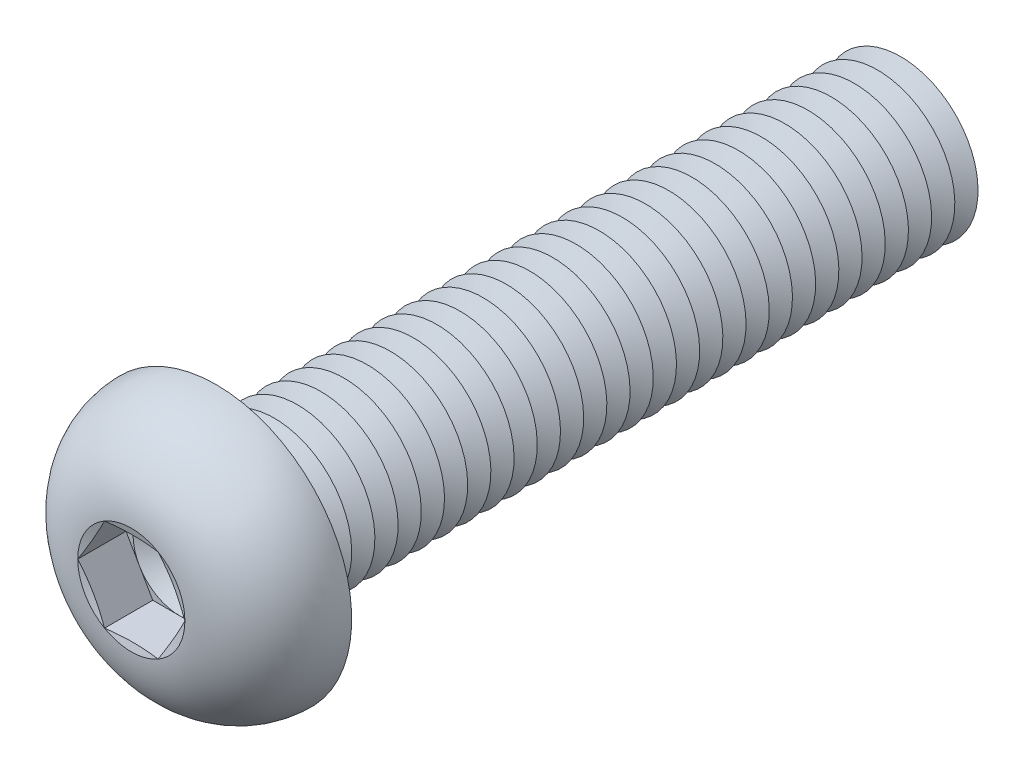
ISO-10303-21;
HEADER;
FILE_DESCRIPTION(('STEP AP214'),'2;1');
FILE_NAME('part.step','',(''),(''),'','','');
FILE_SCHEMA(('AUTOMOTIVE_DESIGN { 1 0 10303 214 1 1 1 1 }'));
ENDSEC;
DATA;
#1=APPLICATION_CONTEXT('core data for automotive mechanical design processes');
#2=APPLICATION_PROTOCOL_DEFINITION('international standard','automotive_design',2000,#1);
#3=PRODUCT_CONTEXT('',#1,'mechanical');
#4=PRODUCT('Part','Part','',(#3));
#5=PRODUCT_RELATED_PRODUCT_CATEGORY('part','',(#4));
#6=PRODUCT_DEFINITION_FORMATION('','',#4);
#7=PRODUCT_DEFINITION_CONTEXT('part definition',#1,'design');
#8=PRODUCT_DEFINITION('design','',#6,#7);
#9=PRODUCT_DEFINITION_SHAPE('','',#8);
#10=(LENGTH_UNIT() NAMED_UNIT(*) SI_UNIT(.MILLI.,.METRE.));
#11=(NAMED_UNIT(*) PLANE_ANGLE_UNIT() SI_UNIT($,.RADIAN.));
#12=(NAMED_UNIT(*) SI_UNIT($,.STERADIAN.) SOLID_ANGLE_UNIT());
#13=UNCERTAINTY_MEASURE_WITH_UNIT(LENGTH_MEASURE(1.E-05),#10,'distance_accuracy_value','');
#14=(GEOMETRIC_REPRESENTATION_CONTEXT(3) GLOBAL_UNCERTAINTY_ASSIGNED_CONTEXT((#13)) GLOBAL_UNIT_ASSIGNED_CONTEXT((#10,
#11,#12)) REPRESENTATION_CONTEXT('',''));
#15=CARTESIAN_POINT('',(0.,0.,0.));
#16=DIRECTION('',(0.,0.,1.));
#17=DIRECTION('',(1.,0.,0.));
#18=AXIS2_PLACEMENT_3D('',#15,#16,#17);
#19=CARTESIAN_POINT('',(0.,0.,2.38));
#20=DIRECTION('',(0.,0.,1.));
#21=DIRECTION('',(1.,0.,0.));
#22=AXIS2_PLACEMENT_3D('',#19,#20,#21);
#23=PLANE('',#22);
#24=CARTESIAN_POINT('',(0.,0.,2.38));
#25=DIRECTION('',(0.,0.,1.));
#26=DIRECTION('',(1.,0.,0.));
#27=AXIS2_PLACEMENT_3D('',#24,#25,#26);
#28=CIRCLE('',#27,2.99999860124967);
#29=CARTESIAN_POINT('',(2.598075,1.49999930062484,2.38));
#30=VERTEX_POINT('',#29);
#31=CARTESIAN_POINT('',(0.,2.99999860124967,2.38));
#32=VERTEX_POINT('',#31);
#33=EDGE_CURVE('E118',#30,#32,#28,.T.);
#34=ORIENTED_EDGE('',*,*,#33,.F.);
#35=DIRECTION('',(-0.500000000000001,0.866025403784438,0.));
#36=VECTOR('',#35,1.);
#37=CARTESIAN_POINT('',(3.4641,0.,2.38));
#38=LINE('',#37,#36);
#39=CARTESIAN_POINT('',(1.73205,2.99999860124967,2.38));
#40=VERTEX_POINT('',#39);
#41=EDGE_CURVE('E125',#30,#40,#38,.T.);
#42=ORIENTED_EDGE('',*,*,#41,.T.);
#43=DIRECTION('',(-1.,0.,0.));
#44=VECTOR('',#43,1.);
#45=CARTESIAN_POINT('',(1.73205,2.99999860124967,2.38));
#46=LINE('',#45,#44);
#47=EDGE_CURVE('E136',#40,#32,#46,.T.);
#48=ORIENTED_EDGE('',*,*,#47,.T.);
#49=EDGE_LOOP('',(#34,#42,#48));
#50=FACE_BOUND('',#49,.T.);
#51=ADVANCED_FACE('F39',(#50),#23,.T.);
#52=CARTESIAN_POINT('',(0.,0.,2.38));
#53=DIRECTION('',(0.,0.,1.));
#54=DIRECTION('',(1.,0.,0.));
#55=AXIS2_PLACEMENT_3D('',#52,#53,#54);
#56=CIRCLE('',#55,2.99999860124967);
#57=CARTESIAN_POINT('',(-2.598075,1.49999930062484,2.38));
#58=VERTEX_POINT('',#57);
#59=EDGE_CURVE('E11',#32,#58,#56,.T.);
#60=ORIENTED_EDGE('',*,*,#59,.F.);
#61=CARTESIAN_POINT('',(-1.73205,2.99999860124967,2.38));
#62=VERTEX_POINT('',#61);
#63=EDGE_CURVE('E131',#32,#62,#46,.T.);
#64=ORIENTED_EDGE('',*,*,#63,.T.);
#65=DIRECTION('',(-0.5,-0.866025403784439,0.));
#66=VECTOR('',#65,1.);
#67=CARTESIAN_POINT('',(-1.73205,2.99999860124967,2.38));
#68=LINE('',#67,#66);
#69=EDGE_CURVE('E134',#62,#58,#68,.T.);
#70=ORIENTED_EDGE('',*,*,#69,.T.);
#71=EDGE_LOOP('',(#60,#64,#70));
#72=FACE_BOUND('',#71,.T.);
#73=ADVANCED_FACE('F130',(#72),#23,.T.);
#74=CARTESIAN_POINT('',(-2.598075,-1.49999930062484,2.38));
#75=VERTEX_POINT('',#74);
#76=EDGE_CURVE('E49',#58,#75,#56,.T.);
#77=ORIENTED_EDGE('',*,*,#76,.F.);
#78=CARTESIAN_POINT('',(-3.4641,0.,2.38));
#79=VERTEX_POINT('',#78);
#80=EDGE_CURVE('E143',#58,#79,#68,.T.);
#81=ORIENTED_EDGE('',*,*,#80,.T.);
#82=DIRECTION('',(0.5,-0.866025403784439,0.));
#83=VECTOR('',#82,1.);
#84=CARTESIAN_POINT('',(-3.4641,0.,2.38));
#85=LINE('',#84,#83);
#86=EDGE_CURVE('E151',#79,#75,#85,.T.);
#87=ORIENTED_EDGE('',*,*,#86,.T.);
#88=EDGE_LOOP('',(#77,#81,#87));
#89=FACE_BOUND('',#88,.T.);
#90=ADVANCED_FACE('F610',(#89),#23,.T.);
#91=CARTESIAN_POINT('',(0.,-2.99999860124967,2.38));
#92=VERTEX_POINT('',#91);
#93=EDGE_CURVE('E422',#75,#92,#56,.T.);
#94=ORIENTED_EDGE('',*,*,#93,.F.);
#95=CARTESIAN_POINT('',(-1.73205,-2.99999860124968,2.38));
#96=VERTEX_POINT('',#95);
#97=EDGE_CURVE('E150',#75,#96,#85,.T.);
#98=ORIENTED_EDGE('',*,*,#97,.T.);
#99=DIRECTION('',(1.,0.,0.));
#100=VECTOR('',#99,1.);
#101=CARTESIAN_POINT('',(-1.73205,-2.99999860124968,2.38));
#102=LINE('',#101,#100);
#103=EDGE_CURVE('E156',#96,#92,#102,.T.);
#104=ORIENTED_EDGE('',*,*,#103,.T.);
#105=EDGE_LOOP('',(#94,#98,#104));
#106=FACE_BOUND('',#105,.T.);
#107=ADVANCED_FACE('F618',(#106),#23,.T.);
#108=CARTESIAN_POINT('',(2.598075,-1.49999930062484,2.38));
#109=VERTEX_POINT('',#108);
#110=EDGE_CURVE('E56',#92,#109,#56,.T.);
#111=ORIENTED_EDGE('',*,*,#110,.F.);
#112=CARTESIAN_POINT('',(1.73205,-2.99999860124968,2.38));
#113=VERTEX_POINT('',#112);
#114=EDGE_CURVE('E155',#92,#113,#102,.T.);
#115=ORIENTED_EDGE('',*,*,#114,.T.);
#116=DIRECTION('',(0.5,0.866025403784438,0.));
#117=VECTOR('',#116,1.);
#118=CARTESIAN_POINT('',(1.73205,-2.99999860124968,2.38));
#119=LINE('',#118,#117);
#120=EDGE_CURVE('E161',#113,#109,#119,.T.);
#121=ORIENTED_EDGE('',*,*,#120,.T.);
#122=EDGE_LOOP('',(#111,#115,#121));
#123=FACE_BOUND('',#122,.T.);
#124=ADVANCED_FACE('F613',(#123),#23,.T.);
#125=CARTESIAN_POINT('',(0.,0.,5.5));
#126=DIRECTION('',(0.,0.,1.));
#127=DIRECTION('',(0.,-1.,0.));
#128=AXIS2_PLACEMENT_3D('',#125,#126,#127);
#129=CONICAL_SURFACE('',#128,3.4641,1.30899693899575);
#130=CARTESIAN_POINT('',(3.46421547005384,-0.00020000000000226,5.50003094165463));
#131=CARTESIAN_POINT('',(3.39227822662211,0.124398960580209,5.48074619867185));
#132=CARTESIAN_POINT('',(3.32021054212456,0.249223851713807,5.46323875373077));
#133=CARTESIAN_POINT('',(3.17582062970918,0.499314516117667,5.43247971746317));
#134=CARTESIAN_POINT('',(3.10349831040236,0.624580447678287,5.41922985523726));
#135=CARTESIAN_POINT('',(2.95903767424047,0.874793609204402,5.39775958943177));
#136=CARTESIAN_POINT('',(2.88690033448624,0.999739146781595,5.38951357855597));
#137=CARTESIAN_POINT('',(2.74253364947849,1.2497895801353,5.37845651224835));
#138=CARTESIAN_POINT('',(2.67030432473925,1.37489444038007,5.37564440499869));
#139=CARTESIAN_POINT('',(2.52584567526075,1.6251041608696,5.37564440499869));
#140=CARTESIAN_POINT('',(2.45361635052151,1.75020902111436,5.37845651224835));
#141=CARTESIAN_POINT('',(2.30924966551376,2.00025945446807,5.38951357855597));
#142=CARTESIAN_POINT('',(2.23711232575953,2.12520499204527,5.39775958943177));
#143=CARTESIAN_POINT('',(2.09265168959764,2.37541815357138,5.41922985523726));
#144=CARTESIAN_POINT('',(2.02032937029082,2.500684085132,5.43247971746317));
#145=CARTESIAN_POINT('',(1.87593945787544,2.75077474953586,5.46323875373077));
#146=CARTESIAN_POINT('',(1.80387177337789,2.87559964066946,5.48074619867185));
#147=CARTESIAN_POINT('',(1.73193452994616,3.00019860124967,5.50003094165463));
#148=B_SPLINE_CURVE_WITH_KNOTS('',3,(#130,#131,#132,#133,#134,#135,#136,#137,#138,#139,#140,
#141,#142,#143,#144,#145,#146,#147),.UNSPECIFIED.,.F.,.F.,(4,2,2,2,2,2,2,2,4),(0.,
0.435506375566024,0.871189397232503,1.3046235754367,1.7379738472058,2.1713241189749,
2.6047582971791,3.04044131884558,3.4759476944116),.UNSPECIFIED.);
#149=CARTESIAN_POINT('',(3.4641,0.,5.5));
#150=VERTEX_POINT('',#149);
#151=CARTESIAN_POINT('',(1.73204999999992,2.99999860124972,5.5));
#152=VERTEX_POINT('',#151);
#153=EDGE_CURVE('E227',#150,#152,#148,.T.);
#154=ORIENTED_EDGE('',*,*,#153,.F.);
#155=CARTESIAN_POINT('',(0.,0.,5.5));
#156=DIRECTION('',(0.,0.,-1.));
#157=DIRECTION('',(0.,1.,0.));
#158=AXIS2_PLACEMENT_3D('',#155,#156,#157);
#159=CIRCLE('',#158,3.4641);
#160=EDGE_CURVE('E307',#152,#150,#159,.T.);
#161=ORIENTED_EDGE('',*,*,#160,.F.);
#162=EDGE_LOOP('',(#154,#161));
#163=FACE_BOUND('',#162,.T.);
#164=ADVANCED_FACE('F617',(#163),#129,.F.);
#165=CARTESIAN_POINT('',(1.73193452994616,-3.00019860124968,5.50003094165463));
#166=CARTESIAN_POINT('',(1.80387177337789,-2.87559964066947,5.48074619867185));
#167=CARTESIAN_POINT('',(1.87593945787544,-2.75077474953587,5.46323875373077));
#168=CARTESIAN_POINT('',(2.02032937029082,-2.50068408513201,5.43247971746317));
#169=CARTESIAN_POINT('',(2.09265168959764,-2.37541815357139,5.41922985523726));
#170=CARTESIAN_POINT('',(2.23711232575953,-2.12520499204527,5.39775958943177));
#171=CARTESIAN_POINT('',(2.30924966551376,-2.00025945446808,5.38951357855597));
#172=CARTESIAN_POINT('',(2.45361635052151,-1.75020902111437,5.37845651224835));
#173=CARTESIAN_POINT('',(2.52584567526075,-1.6251041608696,5.37564440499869));
#174=CARTESIAN_POINT('',(2.67030432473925,-1.37489444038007,5.37564440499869));
#175=CARTESIAN_POINT('',(2.74253364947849,-1.24978958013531,5.37845651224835));
#176=CARTESIAN_POINT('',(2.88690033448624,-0.999739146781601,5.38951357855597));
#177=CARTESIAN_POINT('',(2.95903767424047,-0.874793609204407,5.39775958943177));
#178=CARTESIAN_POINT('',(3.10349831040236,-0.624580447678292,5.41922985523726));
#179=CARTESIAN_POINT('',(3.17582062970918,-0.499314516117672,5.43247971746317));
#180=CARTESIAN_POINT('',(3.32021054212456,-0.249223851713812,5.46323875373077));
#181=CARTESIAN_POINT('',(3.39227822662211,-0.124398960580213,5.48074619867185));
#182=CARTESIAN_POINT('',(3.46421547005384,0.000199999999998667,5.50003094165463));
#183=B_SPLINE_CURVE_WITH_KNOTS('',3,(#165,#166,#167,#168,#169,#170,#171,#172,#173,#174,#175,
#176,#177,#178,#179,#180,#181,#182),.UNSPECIFIED.,.F.,.F.,(4,2,2,2,2,2,2,2,4),(0.,
0.435506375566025,0.871189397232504,1.3046235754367,1.7379738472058,2.1713241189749,
2.6047582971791,3.04044131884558,3.4759476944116),.UNSPECIFIED.);
#184=CARTESIAN_POINT('',(1.73205,-2.99999860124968,5.5));
#185=VERTEX_POINT('',#184);
#186=EDGE_CURVE('E230',#185,#150,#183,.T.);
#187=ORIENTED_EDGE('',*,*,#186,.F.);
#188=EDGE_CURVE('E290',#150,#185,#159,.T.);
#189=ORIENTED_EDGE('',*,*,#188,.F.);
#190=EDGE_LOOP('',(#187,#189));
#191=FACE_BOUND('',#190,.T.);
#192=ADVANCED_FACE('F288',(#191),#129,.F.);
#193=CARTESIAN_POINT('',(-5.2273006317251,-2.99999860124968,6.18672552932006));
#194=CARTESIAN_POINT('',(-5.10075887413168,-2.99999860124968,6.1573201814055));
#195=CARTESIAN_POINT('',(-4.97415993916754,-2.99999860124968,6.12816064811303));
#196=CARTESIAN_POINT('',(-4.72082394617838,-2.99999860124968,6.07043857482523));
#197=CARTESIAN_POINT('',(-4.59408688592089,-2.99999860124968,6.04187604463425));
#198=CARTESIAN_POINT('',(-4.21358997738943,-2.99999860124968,5.95723252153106));
#199=CARTESIAN_POINT('',(-3.95959339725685,-2.99999860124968,5.90220706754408));
#200=CARTESIAN_POINT('',(-3.44835573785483,-2.99999860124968,5.79574115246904));
#201=CARTESIAN_POINT('',(-3.19110656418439,-2.99999860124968,5.744339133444));
#202=CARTESIAN_POINT('',(-2.67540790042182,-2.99999860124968,5.64772994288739));
#203=CARTESIAN_POINT('',(-2.41695830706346,-2.99999860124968,5.60252331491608));
#204=CARTESIAN_POINT('',(-1.9055512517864,-2.99999860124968,5.52251897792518));
#205=CARTESIAN_POINT('',(-1.65263426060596,-2.99999860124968,5.48747285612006));
#206=CARTESIAN_POINT('',(-1.27220564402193,-2.99999860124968,5.44439602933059));
#207=CARTESIAN_POINT('',(-1.1452320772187,-2.99999860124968,5.43161987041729));
#208=CARTESIAN_POINT('',(-0.890973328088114,-2.99999860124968,5.40972605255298));
#209=CARTESIAN_POINT('',(-0.763688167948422,-2.99999860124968,5.40060814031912));
#210=CARTESIAN_POINT('',(-0.509442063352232,-2.99999860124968,5.38647457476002));
#211=CARTESIAN_POINT('',(-0.382482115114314,-2.99999860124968,5.38144125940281));
#212=CARTESIAN_POINT('',(-0.128463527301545,-2.99999860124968,5.37566637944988));
#213=CARTESIAN_POINT('',(-0.00140488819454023,-2.99999860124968,5.37492479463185));
#214=CARTESIAN_POINT('',(0.252672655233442,-2.99999860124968,5.37777315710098));
#215=CARTESIAN_POINT('',(0.379691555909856,-2.99999860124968,5.38136342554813));
#216=CARTESIAN_POINT('',(0.633540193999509,-2.99999860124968,5.39268816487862));
#217=CARTESIAN_POINT('',(0.760369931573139,-2.99999860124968,5.40042263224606));
#218=CARTESIAN_POINT('',(1.06836981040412,-2.99999860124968,5.42382465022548));
#219=CARTESIAN_POINT('',(1.24938929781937,-2.99999860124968,5.4414748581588));
#220=CARTESIAN_POINT('',(1.61066786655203,-2.99999860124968,5.48312309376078));
#221=CARTESIAN_POINT('',(1.7909269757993,-2.99999860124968,5.50712088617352));
#222=CARTESIAN_POINT('',(2.15127612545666,-2.99999860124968,5.56013471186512));
#223=CARTESIAN_POINT('',(2.33136383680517,-2.99999860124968,5.58916634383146));
#224=CARTESIAN_POINT('',(2.690892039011,-2.99999860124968,5.65100028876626));
#225=CARTESIAN_POINT('',(2.87033249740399,-2.99999860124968,5.6838027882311));
#226=CARTESIAN_POINT('',(3.23235399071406,-2.99999860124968,5.75295369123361));
#227=CARTESIAN_POINT('',(3.4149236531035,-2.99999860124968,5.78936117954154));
#228=CARTESIAN_POINT('',(3.77960351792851,-2.99999860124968,5.86440648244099));
#229=CARTESIAN_POINT('',(3.96171371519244,-2.99999860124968,5.903044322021));
#230=CARTESIAN_POINT('',(4.32457472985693,-2.99999860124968,5.98179660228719));
#231=CARTESIAN_POINT('',(4.5053275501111,-2.99999860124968,6.02190185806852));
#232=CARTESIAN_POINT('',(4.86652484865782,-2.99999860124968,6.10342152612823));
#233=CARTESIAN_POINT('',(5.04696934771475,-2.99999860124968,6.14483584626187));
#234=CARTESIAN_POINT('',(5.2273006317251,-2.99999860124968,6.18672552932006));
#235=B_SPLINE_CURVE_WITH_KNOTS('',3,(#193,#194,#195,#196,#197,#198,#199,#200,#201,#202,#203,
#204,#205,#206,#207,#208,#209,#210,#211,#212,#213,#214,#215,#216,#217,#218,#219,#220,#221,#222,
#223,#224,#225,#226,#227,#228,#229,#230,#231,#232,#233,#234),.UNSPECIFIED.,.F.,.F.,(4,2,2,2,2,2,
2,2,2,2,2,2,2,2,2,2,2,2,2,2,4),(0.,0.389739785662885,0.779485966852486,1.5591292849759,
2.34608117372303,3.13310206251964,3.8988410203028,4.28164148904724,4.66441544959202,
5.04552531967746,5.42663339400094,5.80776972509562,6.18890573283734,6.73438998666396,
7.27985402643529,7.8270395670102,8.37425218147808,8.93272720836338,9.49120849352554,
10.0466490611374,10.6020506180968),.UNSPECIFIED.);
#236=CARTESIAN_POINT('',(-1.73205,-2.99999860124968,5.5));
#237=VERTEX_POINT('',#236);
#238=EDGE_CURVE('E240',#237,#185,#235,.T.);
#239=ORIENTED_EDGE('',*,*,#238,.F.);
#240=EDGE_CURVE('E295',#185,#237,#159,.T.);
#241=ORIENTED_EDGE('',*,*,#240,.F.);
#242=EDGE_LOOP('',(#239,#241));
#243=FACE_BOUND('',#242,.T.);
#244=ADVANCED_FACE('F296',(#243),#129,.F.);
#245=CARTESIAN_POINT('',(-3.46421547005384,0.000199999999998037,5.50003094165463));
#246=CARTESIAN_POINT('',(-3.39227822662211,-0.124398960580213,5.48074619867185));
#247=CARTESIAN_POINT('',(-3.32021054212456,-0.249223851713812,5.46323875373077));
#248=CARTESIAN_POINT('',(-3.17582062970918,-0.499314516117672,5.43247971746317));
#249=CARTESIAN_POINT('',(-3.10349831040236,-0.624580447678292,5.41922985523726));
#250=CARTESIAN_POINT('',(-2.95903767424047,-0.874793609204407,5.39775958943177));
#251=CARTESIAN_POINT('',(-2.88690033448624,-0.999739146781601,5.38951357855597));
#252=CARTESIAN_POINT('',(-2.74253364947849,-1.24978958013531,5.37845651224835));
#253=CARTESIAN_POINT('',(-2.67030432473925,-1.37489444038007,5.37564440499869));
#254=CARTESIAN_POINT('',(-2.52584567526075,-1.6251041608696,5.37564440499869));
#255=CARTESIAN_POINT('',(-2.45361635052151,-1.75020902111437,5.37845651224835));
#256=CARTESIAN_POINT('',(-2.30924966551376,-2.00025945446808,5.38951357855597));
#257=CARTESIAN_POINT('',(-2.23711232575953,-2.12520499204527,5.39775958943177));
#258=CARTESIAN_POINT('',(-2.09265168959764,-2.37541815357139,5.41922985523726));
#259=CARTESIAN_POINT('',(-2.02032937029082,-2.50068408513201,5.43247971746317));
#260=CARTESIAN_POINT('',(-1.87593945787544,-2.75077474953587,5.46323875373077));
#261=CARTESIAN_POINT('',(-1.80387177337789,-2.87559964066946,5.48074619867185));
#262=CARTESIAN_POINT('',(-1.73193452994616,-3.00019860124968,5.50003094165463));
#263=B_SPLINE_CURVE_WITH_KNOTS('',3,(#245,#246,#247,#248,#249,#250,#251,#252,#253,#254,#255,
#256,#257,#258,#259,#260,#261,#262),.UNSPECIFIED.,.F.,.F.,(4,2,2,2,2,2,2,2,4),(0.,
0.435506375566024,0.871189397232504,1.3046235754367,1.7379738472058,2.1713241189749,
2.6047582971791,3.04044131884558,3.4759476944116),.UNSPECIFIED.);
#264=CARTESIAN_POINT('',(-3.4641,0.,5.5));
#265=VERTEX_POINT('',#264);
#266=EDGE_CURVE('E235',#265,#237,#263,.T.);
#267=ORIENTED_EDGE('',*,*,#266,.F.);
#268=EDGE_CURVE('E301',#237,#265,#159,.T.);
#269=ORIENTED_EDGE('',*,*,#268,.F.);
#270=EDGE_LOOP('',(#267,#269));
#271=FACE_BOUND('',#270,.T.);
#272=ADVANCED_FACE('F637',(#271),#129,.F.);
#273=CARTESIAN_POINT('',(-1.73193452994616,3.00019860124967,5.50003094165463));
#274=CARTESIAN_POINT('',(-1.8038717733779,2.87559964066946,5.48074619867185));
#275=CARTESIAN_POINT('',(-1.87593945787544,2.75077474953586,5.46323875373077));
#276=CARTESIAN_POINT('',(-2.02032937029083,2.500684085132,5.43247971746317));
#277=CARTESIAN_POINT('',(-2.09265168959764,2.37541815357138,5.41922985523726));
#278=CARTESIAN_POINT('',(-2.23711232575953,2.12520499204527,5.39775958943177));
#279=CARTESIAN_POINT('',(-2.30924966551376,2.00025945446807,5.38951357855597));
#280=CARTESIAN_POINT('',(-2.45361635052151,1.75020902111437,5.37845651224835));
#281=CARTESIAN_POINT('',(-2.52584567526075,1.6251041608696,5.37564440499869));
#282=CARTESIAN_POINT('',(-2.67030432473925,1.37489444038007,5.37564440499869));
#283=CARTESIAN_POINT('',(-2.74253364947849,1.2497895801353,5.37845651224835));
#284=CARTESIAN_POINT('',(-2.88690033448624,0.999739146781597,5.38951357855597));
#285=CARTESIAN_POINT('',(-2.95903767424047,0.874793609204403,5.39775958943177));
#286=CARTESIAN_POINT('',(-3.10349831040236,0.624580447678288,5.41922985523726));
#287=CARTESIAN_POINT('',(-3.17582062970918,0.499314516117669,5.43247971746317));
#288=CARTESIAN_POINT('',(-3.32021054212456,0.249223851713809,5.46323875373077));
#289=CARTESIAN_POINT('',(-3.39227822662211,0.12439896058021,5.48074619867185));
#290=CARTESIAN_POINT('',(-3.46421547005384,-0.000200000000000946,5.50003094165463));
#291=B_SPLINE_CURVE_WITH_KNOTS('',3,(#273,#274,#275,#276,#277,#278,#279,#280,#281,#282,#283,
#284,#285,#286,#287,#288,#289,#290),.UNSPECIFIED.,.F.,.F.,(4,2,2,2,2,2,2,2,4),(0.,
0.435506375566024,0.871189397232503,1.3046235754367,1.7379738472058,2.1713241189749,
2.6047582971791,3.04044131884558,3.4759476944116),.UNSPECIFIED.);
#292=CARTESIAN_POINT('',(-1.73205,2.99999860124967,5.5));
#293=VERTEX_POINT('',#292);
#294=EDGE_CURVE('E232',#293,#265,#291,.T.);
#295=ORIENTED_EDGE('',*,*,#294,.F.);
#296=EDGE_CURVE('E320',#265,#293,#159,.T.);
#297=ORIENTED_EDGE('',*,*,#296,.F.);
#298=EDGE_LOOP('',(#295,#297));
#299=FACE_BOUND('',#298,.T.);
#300=ADVANCED_FACE('F640',(#299),#129,.F.);
#301=CARTESIAN_POINT('',(0.,0.,-39.75));
#302=DIRECTION('',(0.,0.,1.));
#303=DIRECTION('',(0.,-1.,0.));
#304=AXIS2_PLACEMENT_3D('',#301,#302,#303);
#305=CONICAL_SURFACE('',#304,4.99999999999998,1.0471975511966);
#306=CARTESIAN_POINT('',(0.,0.,-40.5));
#307=DIRECTION('',(0.,0.,1.));
#308=DIRECTION('',(0.,-1.,0.));
#309=AXIS2_PLACEMENT_3D('',#306,#307,#308);
#310=CIRCLE('',#309,3.70096189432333);
#311=CARTESIAN_POINT('',(0.,-3.7009618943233,-40.5));
#312=VERTEX_POINT('',#311);
#313=EDGE_CURVE('E419',#312,#312,#310,.T.);
#314=ORIENTED_EDGE('',*,*,#313,.T.);
#315=EDGE_LOOP('',(#314));
#316=FACE_BOUND('',#315,.T.);
#317=CARTESIAN_POINT('',(0.,0.,-39.75));
#318=DIRECTION('',(0.,0.,1.));
#319=DIRECTION('',(0.,-1.,0.));
#320=AXIS2_PLACEMENT_3D('',#317,#318,#319);
#321=CIRCLE('',#320,4.99999999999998);
#322=CARTESIAN_POINT('',(0.,-4.99999999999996,-39.75));
#323=VERTEX_POINT('',#322);
#324=EDGE_CURVE('E416',#323,#323,#321,.T.);
#325=ORIENTED_EDGE('',*,*,#324,.F.);
#326=EDGE_LOOP('',(#325));
#327=FACE_BOUND('',#326,.T.);
#328=ADVANCED_FACE('F1099',(#316,#327),#305,.T.);
#329=CARTESIAN_POINT('',(0.,0.,-40.5));
#330=DIRECTION('',(0.,0.,-1.));
#331=DIRECTION('',(0.,1.,0.));
#332=AXIS2_PLACEMENT_3D('',#329,#330,#331);
#333=CONICAL_SURFACE('',#332,3.70096189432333,1.0471975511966);
#334=CARTESIAN_POINT('',(0.,0.,-41.25));
#335=DIRECTION('',(0.,0.,1.));
#336=DIRECTION('',(0.,-1.,0.));
#337=AXIS2_PLACEMENT_3D('',#334,#335,#336);
#338=CIRCLE('',#337,4.99999999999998);
#339=CARTESIAN_POINT('',(0.,-4.99999999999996,-41.25));
#340=VERTEX_POINT('',#339);
#341=EDGE_CURVE('E479',#340,#340,#338,.T.);
#342=ORIENTED_EDGE('',*,*,#341,.T.);
#343=EDGE_LOOP('',(#342));
#344=FACE_BOUND('',#343,.T.);
#345=ORIENTED_EDGE('',*,*,#313,.F.);
#346=EDGE_LOOP('',(#345));
#347=FACE_BOUND('',#346,.T.);
#348=ADVANCED_FACE('F1441',(#344,#347),#333,.T.);
#349=CARTESIAN_POINT('',(0.,4.99999999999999,-45.));
#350=DIRECTION('',(0.,0.,-1.));
#351=DIRECTION('',(0.,1.,0.));
#352=AXIS2_PLACEMENT_3D('',#349,#350,#351);
#353=PLANE('',#352);
#354=CARTESIAN_POINT('',(0.,0.,-45.));
#355=DIRECTION('',(0.,0.,1.));
#356=DIRECTION('',(0.,-1.,0.));
#357=AXIS2_PLACEMENT_3D('',#354,#355,#356);
#358=CIRCLE('',#357,3.70096189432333);
#359=CARTESIAN_POINT('',(0.,-3.7009618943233,-45.));
#360=VERTEX_POINT('',#359);
#361=EDGE_CURVE('E327',#360,#360,#358,.T.);
#362=ORIENTED_EDGE('',*,*,#361,.F.);
#363=EDGE_LOOP('',(#362));
#364=FACE_BOUND('',#363,.T.);
#365=ADVANCED_FACE('F1446',(#364),#353,.T.);
#366=CARTESIAN_POINT('',(0.,0.,-44.25));
#367=DIRECTION('',(0.,0.,1.));
#368=DIRECTION('',(0.,-1.,0.));
#369=AXIS2_PLACEMENT_3D('',#366,#367,#368);
#370=CONICAL_SURFACE('',#369,4.99999999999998,1.0471975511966);
#371=ORIENTED_EDGE('',*,*,#361,.T.);
#372=EDGE_LOOP('',(#371));
#373=FACE_BOUND('',#372,.T.);
#374=CARTESIAN_POINT('',(0.,0.,-44.25));
#375=DIRECTION('',(0.,0.,1.));
#376=DIRECTION('',(0.,-1.,0.));
#377=AXIS2_PLACEMENT_3D('',#374,#375,#376);
#378=CIRCLE('',#377,4.99999999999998);
#379=CARTESIAN_POINT('',(0.,-4.99999999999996,-44.25));
#380=VERTEX_POINT('',#379);
#381=EDGE_CURVE('E396',#380,#380,#378,.T.);
#382=ORIENTED_EDGE('',*,*,#381,.F.);
#383=EDGE_LOOP('',(#382));
#384=FACE_BOUND('',#383,.T.);
#385=ADVANCED_FACE('F1435',(#373,#384),#370,.T.);
#386=CARTESIAN_POINT('',(0.,0.,-43.5));
#387=DIRECTION('',(0.,0.,-1.));
#388=DIRECTION('',(0.,1.,0.));
#389=AXIS2_PLACEMENT_3D('',#386,#387,#388);
#390=CONICAL_SURFACE('',#389,3.70096189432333,1.0471975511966);
#391=ORIENTED_EDGE('',*,*,#381,.T.);
#392=EDGE_LOOP('',(#391));
#393=FACE_BOUND('',#392,.T.);
#394=CARTESIAN_POINT('',(0.,0.,-43.5));
#395=DIRECTION('',(0.,0.,1.));
#396=DIRECTION('',(0.,-1.,0.));
#397=AXIS2_PLACEMENT_3D('',#394,#395,#396);
#398=CIRCLE('',#397,3.70096189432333);
#399=CARTESIAN_POINT('',(0.,-3.7009618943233,-43.5));
#400=VERTEX_POINT('',#399);
#401=EDGE_CURVE('E399',#400,#400,#398,.T.);
#402=ORIENTED_EDGE('',*,*,#401,.F.);
#403=EDGE_LOOP('',(#402));
#404=FACE_BOUND('',#403,.T.);
#405=ADVANCED_FACE('F1425',(#393,#404),#390,.T.);
#406=CARTESIAN_POINT('',(0.,0.,-42.75));
#407=DIRECTION('',(0.,0.,1.));
#408=DIRECTION('',(0.,-1.,0.));
#409=AXIS2_PLACEMENT_3D('',#406,#407,#408);
#410=CONICAL_SURFACE('',#409,4.99999999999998,1.0471975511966);
#411=ORIENTED_EDGE('',*,*,#401,.T.);
#412=EDGE_LOOP('',(#411));
#413=FACE_BOUND('',#412,.T.);
#414=CARTESIAN_POINT('',(0.,0.,-42.75));
#415=DIRECTION('',(0.,0.,1.));
#416=DIRECTION('',(0.,-1.,0.));
#417=AXIS2_PLACEMENT_3D('',#414,#415,#416);
#418=CIRCLE('',#417,4.99999999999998);
#419=CARTESIAN_POINT('',(0.,-4.99999999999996,-42.75));
#420=VERTEX_POINT('',#419);
#421=EDGE_CURVE('E487',#420,#420,#418,.T.);
#422=ORIENTED_EDGE('',*,*,#421,.F.);
#423=EDGE_LOOP('',(#422));
#424=FACE_BOUND('',#423,.T.);
#425=ADVANCED_FACE('F1415',(#413,#424),#410,.T.);
#426=CARTESIAN_POINT('',(0.,0.,-42.));
#427=DIRECTION('',(0.,0.,-1.));
#428=DIRECTION('',(0.,1.,0.));
#429=AXIS2_PLACEMENT_3D('',#426,#427,#428);
#430=CONICAL_SURFACE('',#429,3.70096189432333,1.0471975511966);
#431=ORIENTED_EDGE('',*,*,#421,.T.);
#432=EDGE_LOOP('',(#431));
#433=FACE_BOUND('',#432,.T.);
#434=CARTESIAN_POINT('',(0.,0.,-42.));
#435=DIRECTION('',(0.,0.,1.));
#436=DIRECTION('',(0.,-1.,0.));
#437=AXIS2_PLACEMENT_3D('',#434,#435,#436);
#438=CIRCLE('',#437,3.70096189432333);
#439=CARTESIAN_POINT('',(0.,-3.7009618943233,-42.));
#440=VERTEX_POINT('',#439);
#441=EDGE_CURVE('E483',#440,#440,#438,.T.);
#442=ORIENTED_EDGE('',*,*,#441,.F.);
#443=EDGE_LOOP('',(#442));
#444=FACE_BOUND('',#443,.T.);
#445=ADVANCED_FACE('F1405',(#433,#444),#430,.T.);
#446=CARTESIAN_POINT('',(0.,0.,-41.25));
#447=DIRECTION('',(0.,0.,1.));
#448=DIRECTION('',(0.,-1.,0.));
#449=AXIS2_PLACEMENT_3D('',#446,#447,#448);
#450=CONICAL_SURFACE('',#449,4.99999999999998,1.0471975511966);
#451=ORIENTED_EDGE('',*,*,#441,.T.);
#452=EDGE_LOOP('',(#451));
#453=FACE_BOUND('',#452,.T.);
#454=ORIENTED_EDGE('',*,*,#341,.F.);
#455=EDGE_LOOP('',(#454));
#456=FACE_BOUND('',#455,.T.);
#457=ADVANCED_FACE('F1395',(#453,#456),#450,.T.);
#458=CARTESIAN_POINT('',(0.,0.,-38.25));
#459=DIRECTION('',(0.,0.,1.));
#460=DIRECTION('',(0.,-1.,0.));
#461=AXIS2_PLACEMENT_3D('',#458,#459,#460);
#462=CONICAL_SURFACE('',#461,4.99999999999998,1.0471975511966);
#463=CARTESIAN_POINT('',(0.,0.,-39.));
#464=DIRECTION('',(0.,0.,1.));
#465=DIRECTION('',(0.,-1.,0.));
#466=AXIS2_PLACEMENT_3D('',#463,#464,#465);
#467=CIRCLE('',#466,3.70096189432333);
#468=CARTESIAN_POINT('',(0.,-3.7009618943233,-39.));
#469=VERTEX_POINT('',#468);
#470=EDGE_CURVE('E420',#469,#469,#467,.T.);
#471=ORIENTED_EDGE('',*,*,#470,.T.);
#472=EDGE_LOOP('',(#471));
#473=FACE_BOUND('',#472,.T.);
#474=CARTESIAN_POINT('',(0.,0.,-38.25));
#475=DIRECTION('',(0.,0.,1.));
#476=DIRECTION('',(0.,-1.,0.));
#477=AXIS2_PLACEMENT_3D('',#474,#475,#476);
#478=CIRCLE('',#477,4.99999999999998);
#479=CARTESIAN_POINT('',(0.,-4.99999999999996,-38.25));
#480=VERTEX_POINT('',#479);
#481=EDGE_CURVE('E439',#480,#480,#478,.T.);
#482=ORIENTED_EDGE('',*,*,#481,.F.);
#483=EDGE_LOOP('',(#482));
#484=FACE_BOUND('',#483,.T.);
#485=ADVANCED_FACE('F1385',(#473,#484),#462,.T.);
#486=CARTESIAN_POINT('',(0.,0.,-39.));
#487=DIRECTION('',(0.,0.,-1.));
#488=DIRECTION('',(0.,1.,0.));
#489=AXIS2_PLACEMENT_3D('',#486,#487,#488);
#490=CONICAL_SURFACE('',#489,3.70096189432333,1.0471975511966);
#491=ORIENTED_EDGE('',*,*,#324,.T.);
#492=EDGE_LOOP('',(#491));
#493=FACE_BOUND('',#492,.T.);
#494=ORIENTED_EDGE('',*,*,#470,.F.);
#495=EDGE_LOOP('',(#494));
#496=FACE_BOUND('',#495,.T.);
#497=ADVANCED_FACE('F1375',(#493,#496),#490,.T.);
#498=CARTESIAN_POINT('',(0.,0.,-36.75));
#499=DIRECTION('',(0.,0.,1.));
#500=DIRECTION('',(0.,-1.,0.));
#501=AXIS2_PLACEMENT_3D('',#498,#499,#500);
#502=CONICAL_SURFACE('',#501,4.99999999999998,1.0471975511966);
#503=CARTESIAN_POINT('',(0.,0.,-37.5));
#504=DIRECTION('',(0.,0.,1.));
#505=DIRECTION('',(0.,-1.,0.));
#506=AXIS2_PLACEMENT_3D('',#503,#504,#505);
#507=CIRCLE('',#506,3.70096189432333);
#508=CARTESIAN_POINT('',(0.,-3.7009618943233,-37.5));
#509=VERTEX_POINT('',#508);
#510=EDGE_CURVE('E435',#509,#509,#507,.T.);
#511=ORIENTED_EDGE('',*,*,#510,.T.);
#512=EDGE_LOOP('',(#511));
#513=FACE_BOUND('',#512,.T.);
#514=CARTESIAN_POINT('',(0.,0.,-36.75));
#515=DIRECTION('',(0.,0.,1.));
#516=DIRECTION('',(0.,-1.,0.));
#517=AXIS2_PLACEMENT_3D('',#514,#515,#516);
#518=CIRCLE('',#517,4.99999999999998);
#519=CARTESIAN_POINT('',(0.,-4.99999999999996,-36.75));
#520=VERTEX_POINT('',#519);
#521=EDGE_CURVE('E414',#520,#520,#518,.T.);
#522=ORIENTED_EDGE('',*,*,#521,.F.);
#523=EDGE_LOOP('',(#522));
#524=FACE_BOUND('',#523,.T.);
#525=ADVANCED_FACE('F1365',(#513,#524),#502,.T.);
#526=CARTESIAN_POINT('',(0.,0.,-37.5));
#527=DIRECTION('',(0.,0.,-1.));
#528=DIRECTION('',(0.,1.,0.));
#529=AXIS2_PLACEMENT_3D('',#526,#527,#528);
#530=CONICAL_SURFACE('',#529,3.70096189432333,1.0471975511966);
#531=ORIENTED_EDGE('',*,*,#481,.T.);
#532=EDGE_LOOP('',(#531));
#533=FACE_BOUND('',#532,.T.);
#534=ORIENTED_EDGE('',*,*,#510,.F.);
#535=EDGE_LOOP('',(#534));
#536=FACE_BOUND('',#535,.T.);
#537=ADVANCED_FACE('F1355',(#533,#536),#530,.T.);
#538=CARTESIAN_POINT('',(0.,0.,-35.25));
#539=DIRECTION('',(0.,0.,1.));
#540=DIRECTION('',(0.,-1.,0.));
#541=AXIS2_PLACEMENT_3D('',#538,#539,#540);
#542=CONICAL_SURFACE('',#541,4.99999999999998,1.0471975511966);
#543=CARTESIAN_POINT('',(0.,0.,-36.));
#544=DIRECTION('',(0.,0.,1.));
#545=DIRECTION('',(0.,-1.,0.));
#546=AXIS2_PLACEMENT_3D('',#543,#544,#545);
#547=CIRCLE('',#546,3.70096189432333);
#548=CARTESIAN_POINT('',(0.,-3.70096189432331,-36.));
#549=VERTEX_POINT('',#548);
#550=EDGE_CURVE('E355',#549,#549,#547,.T.);
#551=ORIENTED_EDGE('',*,*,#550,.T.);
#552=EDGE_LOOP('',(#551));
#553=FACE_BOUND('',#552,.T.);
#554=CARTESIAN_POINT('',(0.,0.,-35.25));
#555=DIRECTION('',(0.,0.,1.));
#556=DIRECTION('',(0.,-1.,0.));
#557=AXIS2_PLACEMENT_3D('',#554,#555,#556);
#558=CIRCLE('',#557,4.99999999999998);
#559=CARTESIAN_POINT('',(0.,-4.99999999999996,-35.25));
#560=VERTEX_POINT('',#559);
#561=EDGE_CURVE('E352',#560,#560,#558,.T.);
#562=ORIENTED_EDGE('',*,*,#561,.F.);
#563=EDGE_LOOP('',(#562));
#564=FACE_BOUND('',#563,.T.);
#565=ADVANCED_FACE('F1345',(#553,#564),#542,.T.);
#566=CARTESIAN_POINT('',(0.,0.,-36.));
#567=DIRECTION('',(0.,0.,-1.));
#568=DIRECTION('',(0.,1.,0.));
#569=AXIS2_PLACEMENT_3D('',#566,#567,#568);
#570=CONICAL_SURFACE('',#569,3.70096189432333,1.0471975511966);
#571=ORIENTED_EDGE('',*,*,#521,.T.);
#572=EDGE_LOOP('',(#571));
#573=FACE_BOUND('',#572,.T.);
#574=ORIENTED_EDGE('',*,*,#550,.F.);
#575=EDGE_LOOP('',(#574));
#576=FACE_BOUND('',#575,.T.);
#577=ADVANCED_FACE('F1335',(#573,#576),#570,.T.);
#578=CARTESIAN_POINT('',(0.,0.,-33.75));
#579=DIRECTION('',(0.,0.,1.));
#580=DIRECTION('',(0.,-1.,0.));
#581=AXIS2_PLACEMENT_3D('',#578,#579,#580);
#582=CONICAL_SURFACE('',#581,4.99999999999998,1.0471975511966);
#583=CARTESIAN_POINT('',(0.,0.,-34.5));
#584=DIRECTION('',(0.,0.,1.));
#585=DIRECTION('',(0.,-1.,0.));
#586=AXIS2_PLACEMENT_3D('',#583,#584,#585);
#587=CIRCLE('',#586,3.70096189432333);
#588=CARTESIAN_POINT('',(0.,-3.70096189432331,-34.5));
#589=VERTEX_POINT('',#588);
#590=EDGE_CURVE('E356',#589,#589,#587,.T.);
#591=ORIENTED_EDGE('',*,*,#590,.T.);
#592=EDGE_LOOP('',(#591));
#593=FACE_BOUND('',#592,.T.);
#594=CARTESIAN_POINT('',(0.,0.,-33.75));
#595=DIRECTION('',(0.,0.,1.));
#596=DIRECTION('',(0.,-1.,0.));
#597=AXIS2_PLACEMENT_3D('',#594,#595,#596);
#598=CIRCLE('',#597,4.99999999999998);
#599=CARTESIAN_POINT('',(0.,-4.99999999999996,-33.75));
#600=VERTEX_POINT('',#599);
#601=EDGE_CURVE('E380',#600,#600,#598,.T.);
#602=ORIENTED_EDGE('',*,*,#601,.F.);
#603=EDGE_LOOP('',(#602));
#604=FACE_BOUND('',#603,.T.);
#605=ADVANCED_FACE('F1325',(#593,#604),#582,.T.);
#606=CARTESIAN_POINT('',(0.,0.,-34.5));
#607=DIRECTION('',(0.,0.,-1.));
#608=DIRECTION('',(0.,1.,0.));
#609=AXIS2_PLACEMENT_3D('',#606,#607,#608);
#610=CONICAL_SURFACE('',#609,3.70096189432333,1.0471975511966);
#611=ORIENTED_EDGE('',*,*,#561,.T.);
#612=EDGE_LOOP('',(#611));
#613=FACE_BOUND('',#612,.T.);
#614=ORIENTED_EDGE('',*,*,#590,.F.);
#615=EDGE_LOOP('',(#614));
#616=FACE_BOUND('',#615,.T.);
#617=ADVANCED_FACE('F1315',(#613,#616),#610,.T.);
#618=CARTESIAN_POINT('',(0.,0.,-32.25));
#619=DIRECTION('',(0.,0.,1.));
#620=DIRECTION('',(0.,-1.,0.));
#621=AXIS2_PLACEMENT_3D('',#618,#619,#620);
#622=CONICAL_SURFACE('',#621,4.99999999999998,1.0471975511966);
#623=CARTESIAN_POINT('',(0.,0.,-33.));
#624=DIRECTION('',(0.,0.,1.));
#625=DIRECTION('',(0.,-1.,0.));
#626=AXIS2_PLACEMENT_3D('',#623,#624,#625);
#627=CIRCLE('',#626,3.70096189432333);
#628=CARTESIAN_POINT('',(0.,-3.70096189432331,-33.));
#629=VERTEX_POINT('',#628);
#630=EDGE_CURVE('E378',#629,#629,#627,.T.);
#631=ORIENTED_EDGE('',*,*,#630,.T.);
#632=EDGE_LOOP('',(#631));
#633=FACE_BOUND('',#632,.T.);
#634=CARTESIAN_POINT('',(0.,0.,-32.25));
#635=DIRECTION('',(0.,0.,1.));
#636=DIRECTION('',(0.,-1.,0.));
#637=AXIS2_PLACEMENT_3D('',#634,#635,#636);
#638=CIRCLE('',#637,4.99999999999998);
#639=CARTESIAN_POINT('',(0.,-4.99999999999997,-32.25));
#640=VERTEX_POINT('',#639);
#641=EDGE_CURVE('E381',#640,#640,#638,.T.);
#642=ORIENTED_EDGE('',*,*,#641,.F.);
#643=EDGE_LOOP('',(#642));
#644=FACE_BOUND('',#643,.T.);
#645=ADVANCED_FACE('F1305',(#633,#644),#622,.T.);
#646=CARTESIAN_POINT('',(0.,0.,-33.));
#647=DIRECTION('',(0.,0.,-1.));
#648=DIRECTION('',(0.,1.,0.));
#649=AXIS2_PLACEMENT_3D('',#646,#647,#648);
#650=CONICAL_SURFACE('',#649,3.70096189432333,1.0471975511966);
#651=ORIENTED_EDGE('',*,*,#601,.T.);
#652=EDGE_LOOP('',(#651));
#653=FACE_BOUND('',#652,.T.);
#654=ORIENTED_EDGE('',*,*,#630,.F.);
#655=EDGE_LOOP('',(#654));
#656=FACE_BOUND('',#655,.T.);
#657=ADVANCED_FACE('F1295',(#653,#656),#650,.T.);
#658=CARTESIAN_POINT('',(0.,0.,-30.75));
#659=DIRECTION('',(0.,0.,1.));
#660=DIRECTION('',(0.,-1.,0.));
#661=AXIS2_PLACEMENT_3D('',#658,#659,#660);
#662=CONICAL_SURFACE('',#661,4.99999999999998,1.0471975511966);
#663=CARTESIAN_POINT('',(0.,0.,-31.5));
#664=DIRECTION('',(0.,0.,1.));
#665=DIRECTION('',(0.,-1.,0.));
#666=AXIS2_PLACEMENT_3D('',#663,#664,#665);
#667=CIRCLE('',#666,3.70096189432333);
#668=CARTESIAN_POINT('',(0.,-3.70096189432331,-31.5));
#669=VERTEX_POINT('',#668);
#670=EDGE_CURVE('E332',#669,#669,#667,.T.);
#671=ORIENTED_EDGE('',*,*,#670,.T.);
#672=EDGE_LOOP('',(#671));
#673=FACE_BOUND('',#672,.T.);
#674=CARTESIAN_POINT('',(0.,0.,-30.75));
#675=DIRECTION('',(0.,0.,1.));
#676=DIRECTION('',(0.,-1.,0.));
#677=AXIS2_PLACEMENT_3D('',#674,#675,#676);
#678=CIRCLE('',#677,4.99999999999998);
#679=CARTESIAN_POINT('',(0.,-4.99999999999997,-30.75));
#680=VERTEX_POINT('',#679);
#681=EDGE_CURVE('E431',#680,#680,#678,.T.);
#682=ORIENTED_EDGE('',*,*,#681,.F.);
#683=EDGE_LOOP('',(#682));
#684=FACE_BOUND('',#683,.T.);
#685=ADVANCED_FACE('F1285',(#673,#684),#662,.T.);
#686=CARTESIAN_POINT('',(0.,0.,-31.5));
#687=DIRECTION('',(0.,0.,-1.));
#688=DIRECTION('',(0.,1.,0.));
#689=AXIS2_PLACEMENT_3D('',#686,#687,#688);
#690=CONICAL_SURFACE('',#689,3.70096189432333,1.0471975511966);
#691=ORIENTED_EDGE('',*,*,#641,.T.);
#692=EDGE_LOOP('',(#691));
#693=FACE_BOUND('',#692,.T.);
#694=ORIENTED_EDGE('',*,*,#670,.F.);
#695=EDGE_LOOP('',(#694));
#696=FACE_BOUND('',#695,.T.);
#697=ADVANCED_FACE('F1275',(#693,#696),#690,.T.);
#698=CARTESIAN_POINT('',(0.,0.,-29.25));
#699=DIRECTION('',(0.,0.,1.));
#700=DIRECTION('',(0.,-1.,0.));
#701=AXIS2_PLACEMENT_3D('',#698,#699,#700);
#702=CONICAL_SURFACE('',#701,4.99999999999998,1.0471975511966);
#703=CARTESIAN_POINT('',(0.,0.,-30.));
#704=DIRECTION('',(0.,0.,1.));
#705=DIRECTION('',(0.,-1.,0.));
#706=AXIS2_PLACEMENT_3D('',#703,#704,#705);
#707=CIRCLE('',#706,3.70096189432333);
#708=CARTESIAN_POINT('',(0.,-3.70096189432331,-30.));
#709=VERTEX_POINT('',#708);
#710=EDGE_CURVE('E375',#709,#709,#707,.T.);
#711=ORIENTED_EDGE('',*,*,#710,.T.);
#712=EDGE_LOOP('',(#711));
#713=FACE_BOUND('',#712,.T.);
#714=CARTESIAN_POINT('',(0.,0.,-29.25));
#715=DIRECTION('',(0.,0.,1.));
#716=DIRECTION('',(0.,-1.,0.));
#717=AXIS2_PLACEMENT_3D('',#714,#715,#716);
#718=CIRCLE('',#717,4.99999999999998);
#719=CARTESIAN_POINT('',(0.,-4.99999999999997,-29.25));
#720=VERTEX_POINT('',#719);
#721=EDGE_CURVE('E372',#720,#720,#718,.T.);
#722=ORIENTED_EDGE('',*,*,#721,.F.);
#723=EDGE_LOOP('',(#722));
#724=FACE_BOUND('',#723,.T.);
#725=ADVANCED_FACE('F1265',(#713,#724),#702,.T.);
#726=CARTESIAN_POINT('',(0.,0.,-30.));
#727=DIRECTION('',(0.,0.,-1.));
#728=DIRECTION('',(0.,1.,0.));
#729=AXIS2_PLACEMENT_3D('',#726,#727,#728);
#730=CONICAL_SURFACE('',#729,3.70096189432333,1.0471975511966);
#731=ORIENTED_EDGE('',*,*,#681,.T.);
#732=EDGE_LOOP('',(#731));
#733=FACE_BOUND('',#732,.T.);
#734=ORIENTED_EDGE('',*,*,#710,.F.);
#735=EDGE_LOOP('',(#734));
#736=FACE_BOUND('',#735,.T.);
#737=ADVANCED_FACE('F1256',(#733,#736),#730,.T.);
#738=CARTESIAN_POINT('',(0.,0.,-27.75));
#739=DIRECTION('',(0.,0.,1.));
#740=DIRECTION('',(0.,-1.,0.));
#741=AXIS2_PLACEMENT_3D('',#738,#739,#740);
#742=CONICAL_SURFACE('',#741,4.99999999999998,1.0471975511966);
#743=CARTESIAN_POINT('',(0.,0.,-28.5));
#744=DIRECTION('',(0.,0.,1.));
#745=DIRECTION('',(0.,-1.,0.));
#746=AXIS2_PLACEMENT_3D('',#743,#744,#745);
#747=CIRCLE('',#746,3.70096189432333);
#748=CARTESIAN_POINT('',(0.,-3.70096189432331,-28.5));
#749=VERTEX_POINT('',#748);
#750=EDGE_CURVE('E376',#749,#749,#747,.T.);
#751=ORIENTED_EDGE('',*,*,#750,.T.);
#752=EDGE_LOOP('',(#751));
#753=FACE_BOUND('',#752,.T.);
#754=CARTESIAN_POINT('',(0.,0.,-27.75));
#755=DIRECTION('',(0.,0.,1.));
#756=DIRECTION('',(0.,-1.,0.));
#757=AXIS2_PLACEMENT_3D('',#754,#755,#756);
#758=CIRCLE('',#757,4.99999999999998);
#759=CARTESIAN_POINT('',(0.,-4.99999999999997,-27.75));
#760=VERTEX_POINT('',#759);
#761=EDGE_CURVE('E451',#760,#760,#758,.T.);
#762=ORIENTED_EDGE('',*,*,#761,.F.);
#763=EDGE_LOOP('',(#762));
#764=FACE_BOUND('',#763,.T.);
#765=ADVANCED_FACE('F1246',(#753,#764),#742,.T.);
#766=CARTESIAN_POINT('',(0.,0.,-28.5));
#767=DIRECTION('',(0.,0.,-1.));
#768=DIRECTION('',(0.,1.,0.));
#769=AXIS2_PLACEMENT_3D('',#766,#767,#768);
#770=CONICAL_SURFACE('',#769,3.70096189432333,1.0471975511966);
#771=ORIENTED_EDGE('',*,*,#721,.T.);
#772=EDGE_LOOP('',(#771));
#773=FACE_BOUND('',#772,.T.);
#774=ORIENTED_EDGE('',*,*,#750,.F.);
#775=EDGE_LOOP('',(#774));
#776=FACE_BOUND('',#775,.T.);
#777=ADVANCED_FACE('F604',(#773,#776),#770,.T.);
#778=CARTESIAN_POINT('',(0.,0.,-26.25));
#779=DIRECTION('',(0.,0.,1.));
#780=DIRECTION('',(0.,-1.,0.));
#781=AXIS2_PLACEMENT_3D('',#778,#779,#780);
#782=CONICAL_SURFACE('',#781,4.99999999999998,1.0471975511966);
#783=CARTESIAN_POINT('',(0.,0.,-27.));
#784=DIRECTION('',(0.,0.,1.));
#785=DIRECTION('',(0.,-1.,0.));
#786=AXIS2_PLACEMENT_3D('',#783,#784,#785);
#787=CIRCLE('',#786,3.70096189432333);
#788=CARTESIAN_POINT('',(0.,-3.70096189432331,-27.));
#789=VERTEX_POINT('',#788);
#790=EDGE_CURVE('E349',#789,#789,#787,.T.);
#791=ORIENTED_EDGE('',*,*,#790,.T.);
#792=EDGE_LOOP('',(#791));
#793=FACE_BOUND('',#792,.T.);
#794=CARTESIAN_POINT('',(0.,0.,-26.25));
#795=DIRECTION('',(0.,0.,1.));
#796=DIRECTION('',(0.,-1.,0.));
#797=AXIS2_PLACEMENT_3D('',#794,#795,#796);
#798=CIRCLE('',#797,4.99999999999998);
#799=CARTESIAN_POINT('',(0.,-4.99999999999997,-26.25));
#800=VERTEX_POINT('',#799);
#801=EDGE_CURVE('E346',#800,#800,#798,.T.);
#802=ORIENTED_EDGE('',*,*,#801,.F.);
#803=EDGE_LOOP('',(#802));
#804=FACE_BOUND('',#803,.T.);
#805=ADVANCED_FACE('F589',(#793,#804),#782,.T.);
#806=CARTESIAN_POINT('',(0.,0.,-27.));
#807=DIRECTION('',(0.,0.,-1.));
#808=DIRECTION('',(0.,1.,0.));
#809=AXIS2_PLACEMENT_3D('',#806,#807,#808);
#810=CONICAL_SURFACE('',#809,3.70096189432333,1.0471975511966);
#811=ORIENTED_EDGE('',*,*,#761,.T.);
#812=EDGE_LOOP('',(#811));
#813=FACE_BOUND('',#812,.T.);
#814=ORIENTED_EDGE('',*,*,#790,.F.);
#815=EDGE_LOOP('',(#814));
#816=FACE_BOUND('',#815,.T.);
#817=ADVANCED_FACE('F592',(#813,#816),#810,.T.);
#818=CARTESIAN_POINT('',(0.,0.,-24.75));
#819=DIRECTION('',(0.,0.,1.));
#820=DIRECTION('',(0.,-1.,0.));
#821=AXIS2_PLACEMENT_3D('',#818,#819,#820);
#822=CONICAL_SURFACE('',#821,4.99999999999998,1.0471975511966);
#823=CARTESIAN_POINT('',(0.,0.,-25.5));
#824=DIRECTION('',(0.,0.,1.));
#825=DIRECTION('',(0.,-1.,0.));
#826=AXIS2_PLACEMENT_3D('',#823,#824,#825);
#827=CIRCLE('',#826,3.70096189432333);
#828=CARTESIAN_POINT('',(0.,-3.70096189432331,-25.5));
#829=VERTEX_POINT('',#828);
#830=EDGE_CURVE('E350',#829,#829,#827,.T.);
#831=ORIENTED_EDGE('',*,*,#830,.T.);
#832=EDGE_LOOP('',(#831));
#833=FACE_BOUND('',#832,.T.);
#834=CARTESIAN_POINT('',(0.,0.,-24.75));
#835=DIRECTION('',(0.,0.,1.));
#836=DIRECTION('',(0.,-1.,0.));
#837=AXIS2_PLACEMENT_3D('',#834,#835,#836);
#838=CIRCLE('',#837,4.99999999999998);
#839=CARTESIAN_POINT('',(0.,-4.99999999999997,-24.75));
#840=VERTEX_POINT('',#839);
#841=EDGE_CURVE('E343',#840,#840,#838,.T.);
#842=ORIENTED_EDGE('',*,*,#841,.F.);
#843=EDGE_LOOP('',(#842));
#844=FACE_BOUND('',#843,.T.);
#845=ADVANCED_FACE('F594',(#833,#844),#822,.T.);
#846=CARTESIAN_POINT('',(0.,0.,-25.5));
#847=DIRECTION('',(0.,0.,-1.));
#848=DIRECTION('',(0.,1.,0.));
#849=AXIS2_PLACEMENT_3D('',#846,#847,#848);
#850=CONICAL_SURFACE('',#849,3.70096189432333,1.0471975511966);
#851=ORIENTED_EDGE('',*,*,#801,.T.);
#852=EDGE_LOOP('',(#851));
#853=FACE_BOUND('',#852,.T.);
#854=ORIENTED_EDGE('',*,*,#830,.F.);
#855=EDGE_LOOP('',(#854));
#856=FACE_BOUND('',#855,.T.);
#857=ADVANCED_FACE('F601',(#853,#856),#850,.T.);
#858=CARTESIAN_POINT('',(0.,0.,-23.25));
#859=DIRECTION('',(0.,0.,1.));
#860=DIRECTION('',(0.,-1.,0.));
#861=AXIS2_PLACEMENT_3D('',#858,#859,#860);
#862=CONICAL_SURFACE('',#861,4.99999999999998,1.0471975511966);
#863=CARTESIAN_POINT('',(0.,0.,-24.));
#864=DIRECTION('',(0.,0.,1.));
#865=DIRECTION('',(0.,-1.,0.));
#866=AXIS2_PLACEMENT_3D('',#863,#864,#865);
#867=CIRCLE('',#866,3.70096189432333);
#868=CARTESIAN_POINT('',(0.,-3.70096189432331,-24.));
#869=VERTEX_POINT('',#868);
#870=EDGE_CURVE('E340',#869,#869,#867,.T.);
#871=ORIENTED_EDGE('',*,*,#870,.T.);
#872=EDGE_LOOP('',(#871));
#873=FACE_BOUND('',#872,.T.);
#874=CARTESIAN_POINT('',(0.,0.,-23.25));
#875=DIRECTION('',(0.,0.,1.));
#876=DIRECTION('',(0.,-1.,0.));
#877=AXIS2_PLACEMENT_3D('',#874,#875,#876);
#878=CIRCLE('',#877,4.99999999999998);
#879=CARTESIAN_POINT('',(0.,-4.99999999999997,-23.25));
#880=VERTEX_POINT('',#879);
#881=EDGE_CURVE('E344',#880,#880,#878,.T.);
#882=ORIENTED_EDGE('',*,*,#881,.F.);
#883=EDGE_LOOP('',(#882));
#884=FACE_BOUND('',#883,.T.);
#885=ADVANCED_FACE('F782',(#873,#884),#862,.T.);
#886=CARTESIAN_POINT('',(0.,0.,-24.));
#887=DIRECTION('',(0.,0.,-1.));
#888=DIRECTION('',(0.,1.,0.));
#889=AXIS2_PLACEMENT_3D('',#886,#887,#888);
#890=CONICAL_SURFACE('',#889,3.70096189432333,1.0471975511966);
#891=ORIENTED_EDGE('',*,*,#841,.T.);
#892=EDGE_LOOP('',(#891));
#893=FACE_BOUND('',#892,.T.);
#894=ORIENTED_EDGE('',*,*,#870,.F.);
#895=EDGE_LOOP('',(#894));
#896=FACE_BOUND('',#895,.T.);
#897=ADVANCED_FACE('F778',(#893,#896),#890,.T.);
#898=CARTESIAN_POINT('',(0.,0.,-21.75));
#899=DIRECTION('',(0.,0.,1.));
#900=DIRECTION('',(0.,-1.,0.));
#901=AXIS2_PLACEMENT_3D('',#898,#899,#900);
#902=CONICAL_SURFACE('',#901,4.99999999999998,1.0471975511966);
#903=CARTESIAN_POINT('',(0.,0.,-22.5));
#904=DIRECTION('',(0.,0.,1.));
#905=DIRECTION('',(0.,-1.,0.));
#906=AXIS2_PLACEMENT_3D('',#903,#904,#905);
#907=CIRCLE('',#906,3.70096189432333);
#908=CARTESIAN_POINT('',(0.,-3.70096189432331,-22.5));
#909=VERTEX_POINT('',#908);
#910=EDGE_CURVE('E392',#909,#909,#907,.T.);
#911=ORIENTED_EDGE('',*,*,#910,.T.);
#912=EDGE_LOOP('',(#911));
#913=FACE_BOUND('',#912,.T.);
#914=CARTESIAN_POINT('',(0.,0.,-21.75));
#915=DIRECTION('',(0.,0.,1.));
#916=DIRECTION('',(0.,-1.,0.));
#917=AXIS2_PLACEMENT_3D('',#914,#915,#916);
#918=CIRCLE('',#917,4.99999999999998);
#919=CARTESIAN_POINT('',(0.,-4.99999999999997,-21.75));
#920=VERTEX_POINT('',#919);
#921=EDGE_CURVE('E389',#920,#920,#918,.T.);
#922=ORIENTED_EDGE('',*,*,#921,.F.);
#923=EDGE_LOOP('',(#922));
#924=FACE_BOUND('',#923,.T.);
#925=ADVANCED_FACE('F774',(#913,#924),#902,.T.);
#926=CARTESIAN_POINT('',(0.,0.,-22.5));
#927=DIRECTION('',(0.,0.,-1.));
#928=DIRECTION('',(0.,1.,0.));
#929=AXIS2_PLACEMENT_3D('',#926,#927,#928);
#930=CONICAL_SURFACE('',#929,3.70096189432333,1.0471975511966);
#931=ORIENTED_EDGE('',*,*,#881,.T.);
#932=EDGE_LOOP('',(#931));
#933=FACE_BOUND('',#932,.T.);
#934=ORIENTED_EDGE('',*,*,#910,.F.);
#935=EDGE_LOOP('',(#934));
#936=FACE_BOUND('',#935,.T.);
#937=ADVANCED_FACE('F770',(#933,#936),#930,.T.);
#938=CARTESIAN_POINT('',(0.,0.,-20.25));
#939=DIRECTION('',(0.,0.,1.));
#940=DIRECTION('',(0.,-1.,0.));
#941=AXIS2_PLACEMENT_3D('',#938,#939,#940);
#942=CONICAL_SURFACE('',#941,4.99999999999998,1.0471975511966);
#943=CARTESIAN_POINT('',(0.,0.,-21.));
#944=DIRECTION('',(0.,0.,1.));
#945=DIRECTION('',(0.,-1.,0.));
#946=AXIS2_PLACEMENT_3D('',#943,#944,#945);
#947=CIRCLE('',#946,3.70096189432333);
#948=CARTESIAN_POINT('',(0.,-3.70096189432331,-21.));
#949=VERTEX_POINT('',#948);
#950=EDGE_CURVE('E386',#949,#949,#947,.T.);
#951=ORIENTED_EDGE('',*,*,#950,.T.);
#952=EDGE_LOOP('',(#951));
#953=FACE_BOUND('',#952,.T.);
#954=CARTESIAN_POINT('',(0.,0.,-20.25));
#955=DIRECTION('',(0.,0.,1.));
#956=DIRECTION('',(0.,-1.,0.));
#957=AXIS2_PLACEMENT_3D('',#954,#955,#956);
#958=CIRCLE('',#957,4.99999999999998);
#959=CARTESIAN_POINT('',(0.,-4.99999999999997,-20.25));
#960=VERTEX_POINT('',#959);
#961=EDGE_CURVE('E390',#960,#960,#958,.T.);
#962=ORIENTED_EDGE('',*,*,#961,.F.);
#963=EDGE_LOOP('',(#962));
#964=FACE_BOUND('',#963,.T.);
#965=ADVANCED_FACE('F766',(#953,#964),#942,.T.);
#966=CARTESIAN_POINT('',(0.,0.,-21.));
#967=DIRECTION('',(0.,0.,-1.));
#968=DIRECTION('',(0.,1.,0.));
#969=AXIS2_PLACEMENT_3D('',#966,#967,#968);
#970=CONICAL_SURFACE('',#969,3.70096189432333,1.0471975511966);
#971=ORIENTED_EDGE('',*,*,#921,.T.);
#972=EDGE_LOOP('',(#971));
#973=FACE_BOUND('',#972,.T.);
#974=ORIENTED_EDGE('',*,*,#950,.F.);
#975=EDGE_LOOP('',(#974));
#976=FACE_BOUND('',#975,.T.);
#977=ADVANCED_FACE('F762',(#973,#976),#970,.T.);
#978=CARTESIAN_POINT('',(0.,0.,-18.75));
#979=DIRECTION('',(0.,0.,1.));
#980=DIRECTION('',(0.,-1.,0.));
#981=AXIS2_PLACEMENT_3D('',#978,#979,#980);
#982=CONICAL_SURFACE('',#981,4.99999999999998,1.0471975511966);
#983=CARTESIAN_POINT('',(0.,0.,-19.5));
#984=DIRECTION('',(0.,0.,1.));
#985=DIRECTION('',(0.,-1.,0.));
#986=AXIS2_PLACEMENT_3D('',#983,#984,#985);
#987=CIRCLE('',#986,3.70096189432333);
#988=CARTESIAN_POINT('',(0.,-3.70096189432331,-19.5));
#989=VERTEX_POINT('',#988);
#990=EDGE_CURVE('E568',#989,#989,#987,.T.);
#991=ORIENTED_EDGE('',*,*,#990,.T.);
#992=EDGE_LOOP('',(#991));
#993=FACE_BOUND('',#992,.T.);
#994=CARTESIAN_POINT('',(0.,0.,-18.75));
#995=DIRECTION('',(0.,0.,1.));
#996=DIRECTION('',(0.,-1.,0.));
#997=AXIS2_PLACEMENT_3D('',#994,#995,#996);
#998=CIRCLE('',#997,4.99999999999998);
#999=CARTESIAN_POINT('',(0.,-4.99999999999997,-18.75));
#1000=VERTEX_POINT('',#999);
#1001=EDGE_CURVE('E564',#1000,#1000,#998,.T.);
#1002=ORIENTED_EDGE('',*,*,#1001,.F.);
#1003=EDGE_LOOP('',(#1002));
#1004=FACE_BOUND('',#1003,.T.);
#1005=ADVANCED_FACE('F758',(#993,#1004),#982,.T.);
#1006=CARTESIAN_POINT('',(0.,0.,-19.5));
#1007=DIRECTION('',(0.,0.,-1.));
#1008=DIRECTION('',(0.,1.,0.));
#1009=AXIS2_PLACEMENT_3D('',#1006,#1007,#1008);
#1010=CONICAL_SURFACE('',#1009,3.70096189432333,1.0471975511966);
#1011=ORIENTED_EDGE('',*,*,#961,.T.);
#1012=EDGE_LOOP('',(#1011));
#1013=FACE_BOUND('',#1012,.T.);
#1014=ORIENTED_EDGE('',*,*,#990,.F.);
#1015=EDGE_LOOP('',(#1014));
#1016=FACE_BOUND('',#1015,.T.);
#1017=ADVANCED_FACE('F754',(#1013,#1016),#1010,.T.);
#1018=CARTESIAN_POINT('',(0.,0.,-17.25));
#1019=DIRECTION('',(0.,0.,1.));
#1020=DIRECTION('',(0.,-1.,0.));
#1021=AXIS2_PLACEMENT_3D('',#1018,#1019,#1020);
#1022=CONICAL_SURFACE('',#1021,4.99999999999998,1.0471975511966);
#1023=CARTESIAN_POINT('',(0.,0.,-18.));
#1024=DIRECTION('',(0.,0.,1.));
#1025=DIRECTION('',(0.,-1.,0.));
#1026=AXIS2_PLACEMENT_3D('',#1023,#1024,#1025);
#1027=CIRCLE('',#1026,3.70096189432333);
#1028=CARTESIAN_POINT('',(0.,-3.70096189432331,-18.));
#1029=VERTEX_POINT('',#1028);
#1030=EDGE_CURVE('E560',#1029,#1029,#1027,.T.);
#1031=ORIENTED_EDGE('',*,*,#1030,.T.);
#1032=EDGE_LOOP('',(#1031));
#1033=FACE_BOUND('',#1032,.T.);
#1034=CARTESIAN_POINT('',(0.,0.,-17.25));
#1035=DIRECTION('',(0.,0.,1.));
#1036=DIRECTION('',(0.,-1.,0.));
#1037=AXIS2_PLACEMENT_3D('',#1034,#1035,#1036);
#1038=CIRCLE('',#1037,4.99999999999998);
#1039=CARTESIAN_POINT('',(0.,-4.99999999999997,-17.25));
#1040=VERTEX_POINT('',#1039);
#1041=EDGE_CURVE('E556',#1040,#1040,#1038,.T.);
#1042=ORIENTED_EDGE('',*,*,#1041,.F.);
#1043=EDGE_LOOP('',(#1042));
#1044=FACE_BOUND('',#1043,.T.);
#1045=ADVANCED_FACE('F750',(#1033,#1044),#1022,.T.);
#1046=CARTESIAN_POINT('',(0.,0.,-18.));
#1047=DIRECTION('',(0.,0.,-1.));
#1048=DIRECTION('',(0.,1.,0.));
#1049=AXIS2_PLACEMENT_3D('',#1046,#1047,#1048);
#1050=CONICAL_SURFACE('',#1049,3.70096189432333,1.0471975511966);
#1051=ORIENTED_EDGE('',*,*,#1001,.T.);
#1052=EDGE_LOOP('',(#1051));
#1053=FACE_BOUND('',#1052,.T.);
#1054=ORIENTED_EDGE('',*,*,#1030,.F.);
#1055=EDGE_LOOP('',(#1054));
#1056=FACE_BOUND('',#1055,.T.);
#1057=ADVANCED_FACE('F746',(#1053,#1056),#1050,.T.);
#1058=CARTESIAN_POINT('',(0.,0.,-15.75));
#1059=DIRECTION('',(0.,0.,1.));
#1060=DIRECTION('',(0.,-1.,0.));
#1061=AXIS2_PLACEMENT_3D('',#1058,#1059,#1060);
#1062=CONICAL_SURFACE('',#1061,4.99999999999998,1.0471975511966);
#1063=CARTESIAN_POINT('',(0.,0.,-16.5));
#1064=DIRECTION('',(0.,0.,1.));
#1065=DIRECTION('',(0.,-1.,0.));
#1066=AXIS2_PLACEMENT_3D('',#1063,#1064,#1065);
#1067=CIRCLE('',#1066,3.70096189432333);
#1068=CARTESIAN_POINT('',(0.,-3.70096189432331,-16.5));
#1069=VERTEX_POINT('',#1068);
#1070=EDGE_CURVE('E552',#1069,#1069,#1067,.T.);
#1071=ORIENTED_EDGE('',*,*,#1070,.T.);
#1072=EDGE_LOOP('',(#1071));
#1073=FACE_BOUND('',#1072,.T.);
#1074=CARTESIAN_POINT('',(0.,0.,-15.75));
#1075=DIRECTION('',(0.,0.,1.));
#1076=DIRECTION('',(0.,-1.,0.));
#1077=AXIS2_PLACEMENT_3D('',#1074,#1075,#1076);
#1078=CIRCLE('',#1077,4.99999999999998);
#1079=CARTESIAN_POINT('',(0.,-4.99999999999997,-15.75));
#1080=VERTEX_POINT('',#1079);
#1081=EDGE_CURVE('E548',#1080,#1080,#1078,.T.);
#1082=ORIENTED_EDGE('',*,*,#1081,.F.);
#1083=EDGE_LOOP('',(#1082));
#1084=FACE_BOUND('',#1083,.T.);
#1085=ADVANCED_FACE('F742',(#1073,#1084),#1062,.T.);
#1086=CARTESIAN_POINT('',(0.,0.,-16.5));
#1087=DIRECTION('',(0.,0.,-1.));
#1088=DIRECTION('',(0.,1.,0.));
#1089=AXIS2_PLACEMENT_3D('',#1086,#1087,#1088);
#1090=CONICAL_SURFACE('',#1089,3.70096189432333,1.0471975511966);
#1091=ORIENTED_EDGE('',*,*,#1041,.T.);
#1092=EDGE_LOOP('',(#1091));
#1093=FACE_BOUND('',#1092,.T.);
#1094=ORIENTED_EDGE('',*,*,#1070,.F.);
#1095=EDGE_LOOP('',(#1094));
#1096=FACE_BOUND('',#1095,.T.);
#1097=ADVANCED_FACE('F738',(#1093,#1096),#1090,.T.);
#1098=CARTESIAN_POINT('',(0.,0.,-14.25));
#1099=DIRECTION('',(0.,0.,1.));
#1100=DIRECTION('',(0.,-1.,0.));
#1101=AXIS2_PLACEMENT_3D('',#1098,#1099,#1100);
#1102=CONICAL_SURFACE('',#1101,4.99999999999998,1.0471975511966);
#1103=CARTESIAN_POINT('',(0.,0.,-15.));
#1104=DIRECTION('',(0.,0.,1.));
#1105=DIRECTION('',(0.,-1.,0.));
#1106=AXIS2_PLACEMENT_3D('',#1103,#1104,#1105);
#1107=CIRCLE('',#1106,3.70096189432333);
#1108=CARTESIAN_POINT('',(0.,-3.70096189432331,-15.));
#1109=VERTEX_POINT('',#1108);
#1110=EDGE_CURVE('E544',#1109,#1109,#1107,.T.);
#1111=ORIENTED_EDGE('',*,*,#1110,.T.);
#1112=EDGE_LOOP('',(#1111));
#1113=FACE_BOUND('',#1112,.T.);
#1114=CARTESIAN_POINT('',(0.,0.,-14.25));
#1115=DIRECTION('',(0.,0.,1.));
#1116=DIRECTION('',(0.,-1.,0.));
#1117=AXIS2_PLACEMENT_3D('',#1114,#1115,#1116);
#1118=CIRCLE('',#1117,4.99999999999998);
#1119=CARTESIAN_POINT('',(0.,-4.99999999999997,-14.25));
#1120=VERTEX_POINT('',#1119);
#1121=EDGE_CURVE('E406',#1120,#1120,#1118,.T.);
#1122=ORIENTED_EDGE('',*,*,#1121,.F.);
#1123=EDGE_LOOP('',(#1122));
#1124=FACE_BOUND('',#1123,.T.);
#1125=ADVANCED_FACE('F734',(#1113,#1124),#1102,.T.);
#1126=CARTESIAN_POINT('',(0.,0.,-15.));
#1127=DIRECTION('',(0.,0.,-1.));
#1128=DIRECTION('',(0.,1.,0.));
#1129=AXIS2_PLACEMENT_3D('',#1126,#1127,#1128);
#1130=CONICAL_SURFACE('',#1129,3.70096189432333,1.0471975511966);
#1131=ORIENTED_EDGE('',*,*,#1081,.T.);
#1132=EDGE_LOOP('',(#1131));
#1133=FACE_BOUND('',#1132,.T.);
#1134=ORIENTED_EDGE('',*,*,#1110,.F.);
#1135=EDGE_LOOP('',(#1134));
#1136=FACE_BOUND('',#1135,.T.);
#1137=ADVANCED_FACE('F730',(#1133,#1136),#1130,.T.);
#1138=CARTESIAN_POINT('',(0.,0.,-12.75));
#1139=DIRECTION('',(0.,0.,1.));
#1140=DIRECTION('',(0.,-1.,0.));
#1141=AXIS2_PLACEMENT_3D('',#1138,#1139,#1140);
#1142=CONICAL_SURFACE('',#1141,4.99999999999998,1.0471975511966);
#1143=CARTESIAN_POINT('',(0.,0.,-13.5));
#1144=DIRECTION('',(0.,0.,1.));
#1145=DIRECTION('',(0.,-1.,0.));
#1146=AXIS2_PLACEMENT_3D('',#1143,#1144,#1145);
#1147=CIRCLE('',#1146,3.70096189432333);
#1148=CARTESIAN_POINT('',(0.,-3.70096189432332,-13.5));
#1149=VERTEX_POINT('',#1148);
#1150=EDGE_CURVE('E403',#1149,#1149,#1147,.T.);
#1151=ORIENTED_EDGE('',*,*,#1150,.T.);
#1152=EDGE_LOOP('',(#1151));
#1153=FACE_BOUND('',#1152,.T.);
#1154=CARTESIAN_POINT('',(0.,0.,-12.75));
#1155=DIRECTION('',(0.,0.,1.));
#1156=DIRECTION('',(0.,-1.,0.));
#1157=AXIS2_PLACEMENT_3D('',#1154,#1155,#1156);
#1158=CIRCLE('',#1157,4.99999999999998);
#1159=CARTESIAN_POINT('',(0.,-4.99999999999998,-12.75));
#1160=VERTEX_POINT('',#1159);
#1161=EDGE_CURVE('E407',#1160,#1160,#1158,.T.);
#1162=ORIENTED_EDGE('',*,*,#1161,.F.);
#1163=EDGE_LOOP('',(#1162));
#1164=FACE_BOUND('',#1163,.T.);
#1165=ADVANCED_FACE('F726',(#1153,#1164),#1142,.T.);
#1166=CARTESIAN_POINT('',(0.,0.,-13.5));
#1167=DIRECTION('',(0.,0.,-1.));
#1168=DIRECTION('',(0.,1.,0.));
#1169=AXIS2_PLACEMENT_3D('',#1166,#1167,#1168);
#1170=CONICAL_SURFACE('',#1169,3.70096189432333,1.0471975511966);
#1171=ORIENTED_EDGE('',*,*,#1121,.T.);
#1172=EDGE_LOOP('',(#1171));
#1173=FACE_BOUND('',#1172,.T.);
#1174=ORIENTED_EDGE('',*,*,#1150,.F.);
#1175=EDGE_LOOP('',(#1174));
#1176=FACE_BOUND('',#1175,.T.);
#1177=ADVANCED_FACE('F722',(#1173,#1176),#1170,.T.);
#1178=CARTESIAN_POINT('',(0.,0.,-11.25));
#1179=DIRECTION('',(0.,0.,1.));
#1180=DIRECTION('',(0.,-1.,0.));
#1181=AXIS2_PLACEMENT_3D('',#1178,#1179,#1180);
#1182=CONICAL_SURFACE('',#1181,4.99999999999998,1.0471975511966);
#1183=CARTESIAN_POINT('',(0.,0.,-12.));
#1184=DIRECTION('',(0.,0.,1.));
#1185=DIRECTION('',(0.,-1.,0.));
#1186=AXIS2_PLACEMENT_3D('',#1183,#1184,#1185);
#1187=CIRCLE('',#1186,3.70096189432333);
#1188=CARTESIAN_POINT('',(0.,-3.70096189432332,-12.));
#1189=VERTEX_POINT('',#1188);
#1190=EDGE_CURVE('E424',#1189,#1189,#1187,.T.);
#1191=ORIENTED_EDGE('',*,*,#1190,.T.);
#1192=EDGE_LOOP('',(#1191));
#1193=FACE_BOUND('',#1192,.T.);
#1194=CARTESIAN_POINT('',(0.,0.,-11.25));
#1195=DIRECTION('',(0.,0.,1.));
#1196=DIRECTION('',(0.,-1.,0.));
#1197=AXIS2_PLACEMENT_3D('',#1194,#1195,#1196);
#1198=CIRCLE('',#1197,4.99999999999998);
#1199=CARTESIAN_POINT('',(0.,-4.99999999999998,-11.25));
#1200=VERTEX_POINT('',#1199);
#1201=EDGE_CURVE('E427',#1200,#1200,#1198,.T.);
#1202=ORIENTED_EDGE('',*,*,#1201,.F.);
#1203=EDGE_LOOP('',(#1202));
#1204=FACE_BOUND('',#1203,.T.);
#1205=ADVANCED_FACE('F718',(#1193,#1204),#1182,.T.);
#1206=CARTESIAN_POINT('',(0.,0.,-12.));
#1207=DIRECTION('',(0.,0.,-1.));
#1208=DIRECTION('',(0.,1.,0.));
#1209=AXIS2_PLACEMENT_3D('',#1206,#1207,#1208);
#1210=CONICAL_SURFACE('',#1209,3.70096189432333,1.0471975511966);
#1211=ORIENTED_EDGE('',*,*,#1161,.T.);
#1212=EDGE_LOOP('',(#1211));
#1213=FACE_BOUND('',#1212,.T.);
#1214=ORIENTED_EDGE('',*,*,#1190,.F.);
#1215=EDGE_LOOP('',(#1214));
#1216=FACE_BOUND('',#1215,.T.);
#1217=ADVANCED_FACE('F714',(#1213,#1216),#1210,.T.);
#1218=CARTESIAN_POINT('',(0.,0.,-9.75));
#1219=DIRECTION('',(0.,0.,1.));
#1220=DIRECTION('',(0.,-1.,0.));
#1221=AXIS2_PLACEMENT_3D('',#1218,#1219,#1220);
#1222=CONICAL_SURFACE('',#1221,4.99999999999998,1.0471975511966);
#1223=CARTESIAN_POINT('',(0.,0.,-10.5));
#1224=DIRECTION('',(0.,0.,1.));
#1225=DIRECTION('',(0.,-1.,0.));
#1226=AXIS2_PLACEMENT_3D('',#1223,#1224,#1225);
#1227=CIRCLE('',#1226,3.70096189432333);
#1228=CARTESIAN_POINT('',(0.,-3.70096189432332,-10.5));
#1229=VERTEX_POINT('',#1228);
#1230=EDGE_CURVE('E337',#1229,#1229,#1227,.T.);
#1231=ORIENTED_EDGE('',*,*,#1230,.T.);
#1232=EDGE_LOOP('',(#1231));
#1233=FACE_BOUND('',#1232,.T.);
#1234=CARTESIAN_POINT('',(0.,0.,-9.75));
#1235=DIRECTION('',(0.,0.,1.));
#1236=DIRECTION('',(0.,-1.,0.));
#1237=AXIS2_PLACEMENT_3D('',#1234,#1235,#1236);
#1238=CIRCLE('',#1237,4.99999999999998);
#1239=CARTESIAN_POINT('',(0.,-4.99999999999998,-9.75));
#1240=VERTEX_POINT('',#1239);
#1241=EDGE_CURVE('E334',#1240,#1240,#1238,.T.);
#1242=ORIENTED_EDGE('',*,*,#1241,.F.);
#1243=EDGE_LOOP('',(#1242));
#1244=FACE_BOUND('',#1243,.T.);
#1245=ADVANCED_FACE('F710',(#1233,#1244),#1222,.T.);
#1246=CARTESIAN_POINT('',(0.,0.,-10.5));
#1247=DIRECTION('',(0.,0.,-1.));
#1248=DIRECTION('',(0.,1.,0.));
#1249=AXIS2_PLACEMENT_3D('',#1246,#1247,#1248);
#1250=CONICAL_SURFACE('',#1249,3.70096189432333,1.0471975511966);
#1251=ORIENTED_EDGE('',*,*,#1201,.T.);
#1252=EDGE_LOOP('',(#1251));
#1253=FACE_BOUND('',#1252,.T.);
#1254=ORIENTED_EDGE('',*,*,#1230,.F.);
#1255=EDGE_LOOP('',(#1254));
#1256=FACE_BOUND('',#1255,.T.);
#1257=ADVANCED_FACE('F706',(#1253,#1256),#1250,.T.);
#1258=CARTESIAN_POINT('',(0.,0.,-8.25));
#1259=DIRECTION('',(0.,0.,1.));
#1260=DIRECTION('',(0.,-1.,0.));
#1261=AXIS2_PLACEMENT_3D('',#1258,#1259,#1260);
#1262=CONICAL_SURFACE('',#1261,4.99999999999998,1.0471975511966);
#1263=CARTESIAN_POINT('',(0.,0.,-9.));
#1264=DIRECTION('',(0.,0.,1.));
#1265=DIRECTION('',(0.,-1.,0.));
#1266=AXIS2_PLACEMENT_3D('',#1263,#1264,#1265);
#1267=CIRCLE('',#1266,3.70096189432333);
#1268=CARTESIAN_POINT('',(0.,-3.70096189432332,-9.));
#1269=VERTEX_POINT('',#1268);
#1270=EDGE_CURVE('E338',#1269,#1269,#1267,.T.);
#1271=ORIENTED_EDGE('',*,*,#1270,.T.);
#1272=EDGE_LOOP('',(#1271));
#1273=FACE_BOUND('',#1272,.T.);
#1274=CARTESIAN_POINT('',(0.,0.,-8.25000000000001));
#1275=DIRECTION('',(0.,0.,1.));
#1276=DIRECTION('',(0.,-1.,0.));
#1277=AXIS2_PLACEMENT_3D('',#1274,#1275,#1276);
#1278=CIRCLE('',#1277,4.99999999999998);
#1279=CARTESIAN_POINT('',(0.,-4.99999999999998,-8.25000000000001));
#1280=VERTEX_POINT('',#1279);
#1281=EDGE_CURVE('E444',#1280,#1280,#1278,.T.);
#1282=ORIENTED_EDGE('',*,*,#1281,.F.);
#1283=EDGE_LOOP('',(#1282));
#1284=FACE_BOUND('',#1283,.T.);
#1285=ADVANCED_FACE('F702',(#1273,#1284),#1262,.T.);
#1286=CARTESIAN_POINT('',(0.,0.,-9.));
#1287=DIRECTION('',(0.,0.,-1.));
#1288=DIRECTION('',(0.,1.,0.));
#1289=AXIS2_PLACEMENT_3D('',#1286,#1287,#1288);
#1290=CONICAL_SURFACE('',#1289,3.70096189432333,1.0471975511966);
#1291=ORIENTED_EDGE('',*,*,#1241,.T.);
#1292=EDGE_LOOP('',(#1291));
#1293=FACE_BOUND('',#1292,.T.);
#1294=ORIENTED_EDGE('',*,*,#1270,.F.);
#1295=EDGE_LOOP('',(#1294));
#1296=FACE_BOUND('',#1295,.T.);
#1297=ADVANCED_FACE('F698',(#1293,#1296),#1290,.T.);
#1298=CARTESIAN_POINT('',(0.,0.,-6.75000000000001));
#1299=DIRECTION('',(0.,0.,1.));
#1300=DIRECTION('',(0.,-1.,0.));
#1301=AXIS2_PLACEMENT_3D('',#1298,#1299,#1300);
#1302=CONICAL_SURFACE('',#1301,4.99999999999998,1.0471975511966);
#1303=CARTESIAN_POINT('',(0.,0.,-7.50000000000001));
#1304=DIRECTION('',(0.,0.,1.));
#1305=DIRECTION('',(0.,-1.,0.));
#1306=AXIS2_PLACEMENT_3D('',#1303,#1304,#1305);
#1307=CIRCLE('',#1306,3.70096189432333);
#1308=CARTESIAN_POINT('',(0.,-3.70096189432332,-7.50000000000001));
#1309=VERTEX_POINT('',#1308);
#1310=EDGE_CURVE('E369',#1309,#1309,#1307,.T.);
#1311=ORIENTED_EDGE('',*,*,#1310,.T.);
#1312=EDGE_LOOP('',(#1311));
#1313=FACE_BOUND('',#1312,.T.);
#1314=CARTESIAN_POINT('',(0.,0.,-6.75000000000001));
#1315=DIRECTION('',(0.,0.,1.));
#1316=DIRECTION('',(0.,-1.,0.));
#1317=AXIS2_PLACEMENT_3D('',#1314,#1315,#1316);
#1318=CIRCLE('',#1317,4.99999999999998);
#1319=CARTESIAN_POINT('',(0.,-4.99999999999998,-6.75000000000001));
#1320=VERTEX_POINT('',#1319);
#1321=EDGE_CURVE('E366',#1320,#1320,#1318,.T.);
#1322=ORIENTED_EDGE('',*,*,#1321,.F.);
#1323=EDGE_LOOP('',(#1322));
#1324=FACE_BOUND('',#1323,.T.);
#1325=ADVANCED_FACE('F694',(#1313,#1324),#1302,.T.);
#1326=CARTESIAN_POINT('',(0.,0.,-7.50000000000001));
#1327=DIRECTION('',(0.,0.,-1.));
#1328=DIRECTION('',(0.,1.,0.));
#1329=AXIS2_PLACEMENT_3D('',#1326,#1327,#1328);
#1330=CONICAL_SURFACE('',#1329,3.70096189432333,1.0471975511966);
#1331=ORIENTED_EDGE('',*,*,#1281,.T.);
#1332=EDGE_LOOP('',(#1331));
#1333=FACE_BOUND('',#1332,.T.);
#1334=ORIENTED_EDGE('',*,*,#1310,.F.);
#1335=EDGE_LOOP('',(#1334));
#1336=FACE_BOUND('',#1335,.T.);
#1337=ADVANCED_FACE('F690',(#1333,#1336),#1330,.T.);
#1338=CARTESIAN_POINT('',(0.,0.,-5.25));
#1339=DIRECTION('',(0.,0.,1.));
#1340=DIRECTION('',(0.,-1.,0.));
#1341=AXIS2_PLACEMENT_3D('',#1338,#1339,#1340);
#1342=CONICAL_SURFACE('',#1341,4.99999999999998,1.0471975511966);
#1343=CARTESIAN_POINT('',(0.,0.,-6.00000000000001));
#1344=DIRECTION('',(0.,0.,1.));
#1345=DIRECTION('',(0.,-1.,0.));
#1346=AXIS2_PLACEMENT_3D('',#1343,#1344,#1345);
#1347=CIRCLE('',#1346,3.70096189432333);
#1348=CARTESIAN_POINT('',(0.,-3.70096189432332,-6.00000000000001));
#1349=VERTEX_POINT('',#1348);
#1350=EDGE_CURVE('E370',#1349,#1349,#1347,.T.);
#1351=ORIENTED_EDGE('',*,*,#1350,.T.);
#1352=EDGE_LOOP('',(#1351));
#1353=FACE_BOUND('',#1352,.T.);
#1354=CARTESIAN_POINT('',(0.,0.,-5.25));
#1355=DIRECTION('',(0.,0.,1.));
#1356=DIRECTION('',(0.,-1.,0.));
#1357=AXIS2_PLACEMENT_3D('',#1354,#1355,#1356);
#1358=CIRCLE('',#1357,4.99999999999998);
#1359=CARTESIAN_POINT('',(0.,-4.99999999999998,-5.25000000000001));
#1360=VERTEX_POINT('',#1359);
#1361=EDGE_CURVE('E522',#1360,#1360,#1358,.T.);
#1362=ORIENTED_EDGE('',*,*,#1361,.F.);
#1363=EDGE_LOOP('',(#1362));
#1364=FACE_BOUND('',#1363,.T.);
#1365=ADVANCED_FACE('F686',(#1353,#1364),#1342,.T.);
#1366=CARTESIAN_POINT('',(0.,0.,-6.00000000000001));
#1367=DIRECTION('',(0.,0.,-1.));
#1368=DIRECTION('',(0.,1.,0.));
#1369=AXIS2_PLACEMENT_3D('',#1366,#1367,#1368);
#1370=CONICAL_SURFACE('',#1369,3.70096189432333,1.0471975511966);
#1371=ORIENTED_EDGE('',*,*,#1321,.T.);
#1372=EDGE_LOOP('',(#1371));
#1373=FACE_BOUND('',#1372,.T.);
#1374=ORIENTED_EDGE('',*,*,#1350,.F.);
#1375=EDGE_LOOP('',(#1374));
#1376=FACE_BOUND('',#1375,.T.);
#1377=ADVANCED_FACE('F682',(#1373,#1376),#1370,.T.);
#1378=CARTESIAN_POINT('',(0.,0.,-3.75));
#1379=DIRECTION('',(0.,0.,1.));
#1380=DIRECTION('',(0.,-1.,0.));
#1381=AXIS2_PLACEMENT_3D('',#1378,#1379,#1380);
#1382=CONICAL_SURFACE('',#1381,4.99999999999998,1.0471975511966);
#1383=CARTESIAN_POINT('',(0.,0.,-4.5));
#1384=DIRECTION('',(0.,0.,1.));
#1385=DIRECTION('',(0.,-1.,0.));
#1386=AXIS2_PLACEMENT_3D('',#1383,#1384,#1385);
#1387=CIRCLE('',#1386,3.70096189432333);
#1388=CARTESIAN_POINT('',(0.,-3.70096189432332,-4.50000000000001));
#1389=VERTEX_POINT('',#1388);
#1390=EDGE_CURVE('E518',#1389,#1389,#1387,.T.);
#1391=ORIENTED_EDGE('',*,*,#1390,.T.);
#1392=EDGE_LOOP('',(#1391));
#1393=FACE_BOUND('',#1392,.T.);
#1394=CARTESIAN_POINT('',(0.,0.,-3.75));
#1395=DIRECTION('',(0.,0.,1.));
#1396=DIRECTION('',(0.,-1.,0.));
#1397=AXIS2_PLACEMENT_3D('',#1394,#1395,#1396);
#1398=CIRCLE('',#1397,4.99999999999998);
#1399=CARTESIAN_POINT('',(0.,-4.99999999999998,-3.75000000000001));
#1400=VERTEX_POINT('',#1399);
#1401=EDGE_CURVE('E363',#1400,#1400,#1398,.T.);
#1402=ORIENTED_EDGE('',*,*,#1401,.F.);
#1403=EDGE_LOOP('',(#1402));
#1404=FACE_BOUND('',#1403,.T.);
#1405=ADVANCED_FACE('F676',(#1393,#1404),#1382,.T.);
#1406=CARTESIAN_POINT('',(0.,0.,-4.5));
#1407=DIRECTION('',(0.,0.,-1.));
#1408=DIRECTION('',(0.,1.,0.));
#1409=AXIS2_PLACEMENT_3D('',#1406,#1407,#1408);
#1410=CONICAL_SURFACE('',#1409,3.70096189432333,1.0471975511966);
#1411=ORIENTED_EDGE('',*,*,#1361,.T.);
#1412=EDGE_LOOP('',(#1411));
#1413=FACE_BOUND('',#1412,.T.);
#1414=ORIENTED_EDGE('',*,*,#1390,.F.);
#1415=EDGE_LOOP('',(#1414));
#1416=FACE_BOUND('',#1415,.T.);
#1417=ADVANCED_FACE('F667',(#1413,#1416),#1410,.T.);
#1418=CARTESIAN_POINT('',(0.,0.,-2.25));
#1419=DIRECTION('',(0.,0.,1.));
#1420=DIRECTION('',(0.,-1.,0.));
#1421=AXIS2_PLACEMENT_3D('',#1418,#1419,#1420);
#1422=CONICAL_SURFACE('',#1421,4.99999999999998,1.0471975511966);
#1423=CARTESIAN_POINT('',(0.,0.,-3.));
#1424=DIRECTION('',(0.,0.,1.));
#1425=DIRECTION('',(0.,-1.,0.));
#1426=AXIS2_PLACEMENT_3D('',#1423,#1424,#1425);
#1427=CIRCLE('',#1426,3.70096189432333);
#1428=CARTESIAN_POINT('',(0.,-3.70096189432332,-3.));
#1429=VERTEX_POINT('',#1428);
#1430=EDGE_CURVE('E360',#1429,#1429,#1427,.T.);
#1431=ORIENTED_EDGE('',*,*,#1430,.T.);
#1432=EDGE_LOOP('',(#1431));
#1433=FACE_BOUND('',#1432,.T.);
#1434=CARTESIAN_POINT('',(0.,0.,-2.25));
#1435=DIRECTION('',(0.,0.,1.));
#1436=DIRECTION('',(0.,-1.,0.));
#1437=AXIS2_PLACEMENT_3D('',#1434,#1435,#1436);
#1438=CIRCLE('',#1437,4.99999999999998);
#1439=CARTESIAN_POINT('',(0.,-4.99999999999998,-2.25));
#1440=VERTEX_POINT('',#1439);
#1441=EDGE_CURVE('E510',#1440,#1440,#1438,.T.);
#1442=ORIENTED_EDGE('',*,*,#1441,.F.);
#1443=EDGE_LOOP('',(#1442));
#1444=FACE_BOUND('',#1443,.T.);
#1445=ADVANCED_FACE('F665',(#1433,#1444),#1422,.T.);
#1446=CARTESIAN_POINT('',(0.,0.,-3.));
#1447=DIRECTION('',(0.,0.,-1.));
#1448=DIRECTION('',(0.,1.,0.));
#1449=AXIS2_PLACEMENT_3D('',#1446,#1447,#1448);
#1450=CONICAL_SURFACE('',#1449,3.70096189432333,1.0471975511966);
#1451=ORIENTED_EDGE('',*,*,#1401,.T.);
#1452=EDGE_LOOP('',(#1451));
#1453=FACE_BOUND('',#1452,.T.);
#1454=ORIENTED_EDGE('',*,*,#1430,.F.);
#1455=EDGE_LOOP('',(#1454));
#1456=FACE_BOUND('',#1455,.T.);
#1457=ADVANCED_FACE('F662',(#1453,#1456),#1450,.T.);
#1458=CARTESIAN_POINT('',(0.,0.,-0.750000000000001));
#1459=DIRECTION('',(0.,0.,1.));
#1460=DIRECTION('',(0.,-1.,0.));
#1461=AXIS2_PLACEMENT_3D('',#1458,#1459,#1460);
#1462=CONICAL_SURFACE('',#1461,4.99999999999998,1.0471975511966);
#1463=CARTESIAN_POINT('',(0.,0.,-1.5));
#1464=DIRECTION('',(0.,0.,1.));
#1465=DIRECTION('',(0.,-1.,0.));
#1466=AXIS2_PLACEMENT_3D('',#1463,#1464,#1465);
#1467=CIRCLE('',#1466,3.70096189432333);
#1468=CARTESIAN_POINT('',(0.,-3.70096189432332,-1.5));
#1469=VERTEX_POINT('',#1468);
#1470=EDGE_CURVE('E224',#1469,#1469,#1467,.T.);
#1471=ORIENTED_EDGE('',*,*,#1470,.T.);
#1472=EDGE_LOOP('',(#1471));
#1473=FACE_BOUND('',#1472,.T.);
#1474=CARTESIAN_POINT('',(0.,0.,-0.750000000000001));
#1475=DIRECTION('',(0.,0.,1.));
#1476=DIRECTION('',(0.,-1.,0.));
#1477=AXIS2_PLACEMENT_3D('',#1474,#1475,#1476);
#1478=CIRCLE('',#1477,4.99999999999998);
#1479=CARTESIAN_POINT('',(0.,-4.99999999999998,-0.750000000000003));
#1480=VERTEX_POINT('',#1479);
#1481=EDGE_CURVE('E364',#1480,#1480,#1478,.T.);
#1482=ORIENTED_EDGE('',*,*,#1481,.F.);
#1483=EDGE_LOOP('',(#1482));
#1484=FACE_BOUND('',#1483,.T.);
#1485=ADVANCED_FACE('F654',(#1473,#1484),#1462,.T.);
#1486=CARTESIAN_POINT('',(0.,0.,-1.5));
#1487=DIRECTION('',(0.,0.,-1.));
#1488=DIRECTION('',(0.,1.,0.));
#1489=AXIS2_PLACEMENT_3D('',#1486,#1487,#1488);
#1490=CONICAL_SURFACE('',#1489,3.70096189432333,1.0471975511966);
#1491=ORIENTED_EDGE('',*,*,#1441,.T.);
#1492=EDGE_LOOP('',(#1491));
#1493=FACE_BOUND('',#1492,.T.);
#1494=ORIENTED_EDGE('',*,*,#1470,.F.);
#1495=EDGE_LOOP('',(#1494));
#1496=FACE_BOUND('',#1495,.T.);
#1497=ADVANCED_FACE('F208',(#1493,#1496),#1490,.T.);
#1498=CARTESIAN_POINT('',(5.2273006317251,2.99999860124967,6.18672552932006));
#1499=CARTESIAN_POINT('',(5.10075887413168,2.99999860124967,6.15732018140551));
#1500=CARTESIAN_POINT('',(4.97415993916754,2.99999860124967,6.12816064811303));
#1501=CARTESIAN_POINT('',(4.72082394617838,2.99999860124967,6.07043857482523));
#1502=CARTESIAN_POINT('',(4.59408688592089,2.99999860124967,6.04187604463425));
#1503=CARTESIAN_POINT('',(4.21358997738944,2.99999860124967,5.95723252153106));
#1504=CARTESIAN_POINT('',(3.95959339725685,2.99999860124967,5.90220706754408));
#1505=CARTESIAN_POINT('',(3.44835573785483,2.99999860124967,5.79574115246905));
#1506=CARTESIAN_POINT('',(3.19110656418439,2.99999860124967,5.744339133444));
#1507=CARTESIAN_POINT('',(2.67540790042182,2.99999860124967,5.6477299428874));
#1508=CARTESIAN_POINT('',(2.41695830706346,2.99999860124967,5.60252331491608));
#1509=CARTESIAN_POINT('',(1.9055512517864,2.99999860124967,5.52251897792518));
#1510=CARTESIAN_POINT('',(1.65263426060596,2.99999860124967,5.48747285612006));
#1511=CARTESIAN_POINT('',(1.27220564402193,2.99999860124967,5.44439602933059));
#1512=CARTESIAN_POINT('',(1.1452320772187,2.99999860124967,5.43161987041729));
#1513=CARTESIAN_POINT('',(0.890973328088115,2.99999860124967,5.40972605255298));
#1514=CARTESIAN_POINT('',(0.763688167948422,2.99999860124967,5.40060814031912));
#1515=CARTESIAN_POINT('',(0.509442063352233,2.99999860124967,5.38647457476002));
#1516=CARTESIAN_POINT('',(0.382482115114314,2.99999860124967,5.38144125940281));
#1517=CARTESIAN_POINT('',(0.128463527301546,2.99999860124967,5.37566637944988));
#1518=CARTESIAN_POINT('',(0.00140488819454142,2.99999860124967,5.37492479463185));
#1519=CARTESIAN_POINT('',(-0.252672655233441,2.99999860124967,5.37777315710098));
#1520=CARTESIAN_POINT('',(-0.379691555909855,2.99999860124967,5.38136342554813));
#1521=CARTESIAN_POINT('',(-0.633540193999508,2.99999860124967,5.39268816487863));
#1522=CARTESIAN_POINT('',(-0.760369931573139,2.99999860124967,5.40042263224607));
#1523=CARTESIAN_POINT('',(-1.06836981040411,2.99999860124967,5.42382465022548));
#1524=CARTESIAN_POINT('',(-1.24938929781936,2.99999860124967,5.4414748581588));
#1525=CARTESIAN_POINT('',(-1.61066786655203,2.99999860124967,5.48312309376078));
#1526=CARTESIAN_POINT('',(-1.7909269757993,2.99999860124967,5.50712088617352));
#1527=CARTESIAN_POINT('',(-2.15127612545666,2.99999860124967,5.56013471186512));
#1528=CARTESIAN_POINT('',(-2.33136383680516,2.99999860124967,5.58916634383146));
#1529=CARTESIAN_POINT('',(-2.690892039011,2.99999860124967,5.65100028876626));
#1530=CARTESIAN_POINT('',(-2.87033249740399,2.99999860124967,5.68380278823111));
#1531=CARTESIAN_POINT('',(-3.23235399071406,2.99999860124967,5.75295369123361));
#1532=CARTESIAN_POINT('',(-3.4149236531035,2.99999860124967,5.78936117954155));
#1533=CARTESIAN_POINT('',(-3.77960351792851,2.99999860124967,5.864406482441));
#1534=CARTESIAN_POINT('',(-3.96171371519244,2.99999860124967,5.903044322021));
#1535=CARTESIAN_POINT('',(-4.32457472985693,2.99999860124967,5.98179660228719));
#1536=CARTESIAN_POINT('',(-4.5053275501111,2.99999860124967,6.02190185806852));
#1537=CARTESIAN_POINT('',(-4.86652484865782,2.99999860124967,6.10342152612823));
#1538=CARTESIAN_POINT('',(-5.04696934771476,2.99999860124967,6.14483584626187));
#1539=CARTESIAN_POINT('',(-5.2273006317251,2.99999860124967,6.18672552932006));
#1540=B_SPLINE_CURVE_WITH_KNOTS('',3,(#1498,#1499,#1500,#1501,#1502,#1503,#1504,#1505,#1506,
#1507,#1508,#1509,#1510,#1511,#1512,#1513,#1514,#1515,#1516,#1517,#1518,#1519,#1520,#1521,#1522,
#1523,#1524,#1525,#1526,#1527,#1528,#1529,#1530,#1531,#1532,#1533,#1534,#1535,#1536,#1537,#1538,
#1539),.UNSPECIFIED.,.F.,.F.,(4,2,2,2,2,2,2,2,2,2,2,2,2,2,2,2,2,2,2,2,4),(0.,0.389739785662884,
0.779485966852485,1.5591292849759,2.34608117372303,3.13310206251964,3.8988410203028,
4.28164148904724,4.66441544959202,5.04552531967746,5.42663339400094,5.80776972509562,
6.18890573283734,6.73438998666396,7.27985402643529,7.8270395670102,8.37425218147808,
8.93272720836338,9.49120849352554,10.0466490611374,10.6020506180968),.UNSPECIFIED.);
#1541=EDGE_CURVE('E169',#152,#293,#1540,.T.);
#1542=ORIENTED_EDGE('',*,*,#1541,.F.);
#1543=EDGE_CURVE('E324',#293,#152,#159,.T.);
#1544=ORIENTED_EDGE('',*,*,#1543,.F.);
#1545=EDGE_LOOP('',(#1542,#1544));
#1546=FACE_BOUND('',#1545,.T.);
#1547=ADVANCED_FACE('F192',(#1546),#129,.F.);
#1548=CARTESIAN_POINT('',(0.,0.,0.));
#1549=DIRECTION('',(0.,0.,-1.));
#1550=DIRECTION('',(0.,1.,0.));
#1551=AXIS2_PLACEMENT_3D('',#1548,#1549,#1550);
#1552=DEGENERATE_TOROIDAL_SURFACE('',#1551,3.24566404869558,5.50433595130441,.T.);
#1553=ORIENTED_EDGE('',*,*,#160,.T.);
#1554=ORIENTED_EDGE('',*,*,#188,.T.);
#1555=ORIENTED_EDGE('',*,*,#240,.T.);
#1556=ORIENTED_EDGE('',*,*,#268,.T.);
#1557=ORIENTED_EDGE('',*,*,#296,.T.);
#1558=ORIENTED_EDGE('',*,*,#1543,.T.);
#1559=EDGE_LOOP('',(#1553,#1554,#1555,#1556,#1557,#1558));
#1560=FACE_BOUND('',#1559,.T.);
#1561=CARTESIAN_POINT('',(0.,0.,0.));
#1562=DIRECTION('',(0.,0.,-1.));
#1563=DIRECTION('',(0.,1.,0.));
#1564=AXIS2_PLACEMENT_3D('',#1561,#1562,#1563);
#1565=CIRCLE('',#1564,8.75);
#1566=CARTESIAN_POINT('',(0.,8.75,0.));
#1567=VERTEX_POINT('',#1566);
#1568=EDGE_CURVE('E313',#1567,#1567,#1565,.T.);
#1569=ORIENTED_EDGE('',*,*,#1568,.F.);
#1570=EDGE_LOOP('',(#1569));
#1571=FACE_BOUND('',#1570,.T.);
#1572=ADVANCED_FACE('F303',(#1560,#1571),#1552,.T.);
#1573=CARTESIAN_POINT('',(0.,5.,0.));
#1574=DIRECTION('',(0.,0.,-1.));
#1575=DIRECTION('',(0.,1.,0.));
#1576=AXIS2_PLACEMENT_3D('',#1573,#1574,#1575);
#1577=PLANE('',#1576);
#1578=CARTESIAN_POINT('',(0.,0.,0.));
#1579=DIRECTION('',(0.,0.,-1.));
#1580=DIRECTION('',(0.,1.,0.));
#1581=AXIS2_PLACEMENT_3D('',#1578,#1579,#1580);
#1582=CIRCLE('',#1581,5.74999999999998);
#1583=CARTESIAN_POINT('',(0.,5.74999999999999,0.));
#1584=VERTEX_POINT('',#1583);
#1585=EDGE_CURVE('E384',#1584,#1584,#1582,.F.);
#1586=ORIENTED_EDGE('',*,*,#1585,.T.);
#1587=EDGE_LOOP('',(#1586));
#1588=FACE_BOUND('',#1587,.T.);
#1589=ORIENTED_EDGE('',*,*,#1568,.T.);
#1590=EDGE_LOOP('',(#1589));
#1591=FACE_BOUND('',#1590,.T.);
#1592=ADVANCED_FACE('F502',(#1588,#1591),#1577,.T.);
#1593=CARTESIAN_POINT('',(0.,0.,-0.750000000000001));
#1594=DIRECTION('',(0.,0.,-1.));
#1595=DIRECTION('',(0.,1.,0.));
#1596=AXIS2_PLACEMENT_3D('',#1593,#1594,#1595);
#1597=TOROIDAL_SURFACE('',#1596,5.74999999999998,0.75);
#1598=ORIENTED_EDGE('',*,*,#1585,.F.);
#1599=EDGE_LOOP('',(#1598));
#1600=FACE_BOUND('',#1599,.T.);
#1601=ORIENTED_EDGE('',*,*,#1481,.T.);
#1602=EDGE_LOOP('',(#1601));
#1603=FACE_BOUND('',#1602,.T.);
#1604=ADVANCED_FACE('F41',(#1600,#1603),#1597,.F.);
#1605=CARTESIAN_POINT('',(3.4641,0.,2.38));
#1606=DIRECTION('',(0.866025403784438,0.500000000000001,0.));
#1607=DIRECTION('',(-0.500000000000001,0.866025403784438,0.));
#1608=AXIS2_PLACEMENT_3D('',#1605,#1606,#1607);
#1609=PLANE('',#1608);
#1610=ORIENTED_EDGE('',*,*,#153,.T.);
#1611=DIRECTION('',(0.,0.,1.));
#1612=VECTOR('',#1611,1.);
#1613=CARTESIAN_POINT('',(1.73205,2.99999860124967,2.38));
#1614=LINE('',#1613,#1612);
#1615=EDGE_CURVE('E64',#40,#152,#1614,.T.);
#1616=ORIENTED_EDGE('',*,*,#1615,.F.);
#1617=ORIENTED_EDGE('',*,*,#41,.F.);
#1618=CARTESIAN_POINT('',(3.4641,0.,2.38));
#1619=VERTEX_POINT('',#1618);
#1620=EDGE_CURVE('E140',#1619,#30,#38,.T.);
#1621=ORIENTED_EDGE('',*,*,#1620,.F.);
#1622=DIRECTION('',(0.,0.,1.));
#1623=VECTOR('',#1622,1.);
#1624=CARTESIAN_POINT('',(3.4641,0.,2.38));
#1625=LINE('',#1624,#1623);
#1626=EDGE_CURVE('E165',#1619,#150,#1625,.T.);
#1627=ORIENTED_EDGE('',*,*,#1626,.T.);
#1628=EDGE_LOOP('',(#1610,#1616,#1617,#1621,#1627));
#1629=FACE_BOUND('',#1628,.T.);
#1630=ADVANCED_FACE('F202',(#1629),#1609,.F.);
#1631=CARTESIAN_POINT('',(1.73205,-2.99999860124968,2.38));
#1632=DIRECTION('',(0.866025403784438,-0.5,0.));
#1633=DIRECTION('',(0.5,0.866025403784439,0.));
#1634=AXIS2_PLACEMENT_3D('',#1631,#1632,#1633);
#1635=PLANE('',#1634);
#1636=ORIENTED_EDGE('',*,*,#186,.T.);
#1637=ORIENTED_EDGE('',*,*,#1626,.F.);
#1638=EDGE_CURVE('E160',#109,#1619,#119,.T.);
#1639=ORIENTED_EDGE('',*,*,#1638,.F.);
#1640=ORIENTED_EDGE('',*,*,#120,.F.);
#1641=DIRECTION('',(0.,0.,1.));
#1642=VECTOR('',#1641,1.);
#1643=CARTESIAN_POINT('',(1.73205,-2.99999860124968,2.38));
#1644=LINE('',#1643,#1642);
#1645=EDGE_CURVE('E170',#113,#185,#1644,.T.);
#1646=ORIENTED_EDGE('',*,*,#1645,.T.);
#1647=EDGE_LOOP('',(#1636,#1637,#1639,#1640,#1646));
#1648=FACE_BOUND('',#1647,.T.);
#1649=ADVANCED_FACE('F206',(#1648),#1635,.F.);
#1650=CARTESIAN_POINT('',(-1.73205,-2.99999860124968,2.38));
#1651=DIRECTION('',(0.,-1.,0.));
#1652=DIRECTION('',(0.,0.,-1.));
#1653=AXIS2_PLACEMENT_3D('',#1650,#1651,#1652);
#1654=PLANE('',#1653);
#1655=ORIENTED_EDGE('',*,*,#238,.T.);
#1656=ORIENTED_EDGE('',*,*,#1645,.F.);
#1657=ORIENTED_EDGE('',*,*,#114,.F.);
#1658=ORIENTED_EDGE('',*,*,#103,.F.);
#1659=DIRECTION('',(0.,0.,1.));
#1660=VECTOR('',#1659,1.);
#1661=CARTESIAN_POINT('',(-1.73205,-2.99999860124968,2.38));
#1662=LINE('',#1661,#1660);
#1663=EDGE_CURVE('E175',#96,#237,#1662,.T.);
#1664=ORIENTED_EDGE('',*,*,#1663,.T.);
#1665=EDGE_LOOP('',(#1655,#1656,#1657,#1658,#1664));
#1666=FACE_BOUND('',#1665,.T.);
#1667=ADVANCED_FACE('F250',(#1666),#1654,.F.);
#1668=CARTESIAN_POINT('',(-3.4641,0.,2.38));
#1669=DIRECTION('',(-0.866025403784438,-0.5,0.));
#1670=DIRECTION('',(0.5,-0.866025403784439,0.));
#1671=AXIS2_PLACEMENT_3D('',#1668,#1669,#1670);
#1672=PLANE('',#1671);
#1673=ORIENTED_EDGE('',*,*,#266,.T.);
#1674=ORIENTED_EDGE('',*,*,#1663,.F.);
#1675=ORIENTED_EDGE('',*,*,#97,.F.);
#1676=ORIENTED_EDGE('',*,*,#86,.F.);
#1677=DIRECTION('',(0.,0.,1.));
#1678=VECTOR('',#1677,1.);
#1679=CARTESIAN_POINT('',(-3.4641,0.,2.38));
#1680=LINE('',#1679,#1678);
#1681=EDGE_CURVE('E171',#79,#265,#1680,.T.);
#1682=ORIENTED_EDGE('',*,*,#1681,.T.);
#1683=EDGE_LOOP('',(#1673,#1674,#1675,#1676,#1682));
#1684=FACE_BOUND('',#1683,.T.);
#1685=ADVANCED_FACE('F253',(#1684),#1672,.F.);
#1686=CARTESIAN_POINT('',(-1.73205,2.99999860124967,2.38));
#1687=DIRECTION('',(-0.866025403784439,0.5,0.));
#1688=DIRECTION('',(-0.5,-0.866025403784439,0.));
#1689=AXIS2_PLACEMENT_3D('',#1686,#1687,#1688);
#1690=PLANE('',#1689);
#1691=ORIENTED_EDGE('',*,*,#294,.T.);
#1692=ORIENTED_EDGE('',*,*,#1681,.F.);
#1693=ORIENTED_EDGE('',*,*,#80,.F.);
#1694=ORIENTED_EDGE('',*,*,#69,.F.);
#1695=DIRECTION('',(0.,0.,1.));
#1696=VECTOR('',#1695,1.);
#1697=CARTESIAN_POINT('',(-1.73205,2.99999860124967,2.38));
#1698=LINE('',#1697,#1696);
#1699=EDGE_CURVE('E138',#62,#293,#1698,.T.);
#1700=ORIENTED_EDGE('',*,*,#1699,.T.);
#1701=EDGE_LOOP('',(#1691,#1692,#1693,#1694,#1700));
#1702=FACE_BOUND('',#1701,.T.);
#1703=ADVANCED_FACE('F199',(#1702),#1690,.F.);
#1704=CARTESIAN_POINT('',(1.73205,2.99999860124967,2.38));
#1705=DIRECTION('',(0.,1.,0.));
#1706=DIRECTION('',(-1.,0.,0.));
#1707=AXIS2_PLACEMENT_3D('',#1704,#1705,#1706);
#1708=PLANE('',#1707);
#1709=ORIENTED_EDGE('',*,*,#1541,.T.);
#1710=ORIENTED_EDGE('',*,*,#1699,.F.);
#1711=ORIENTED_EDGE('',*,*,#63,.F.);
#1712=ORIENTED_EDGE('',*,*,#47,.F.);
#1713=ORIENTED_EDGE('',*,*,#1615,.T.);
#1714=EDGE_LOOP('',(#1709,#1710,#1711,#1712,#1713));
#1715=FACE_BOUND('',#1714,.T.);
#1716=ADVANCED_FACE('F135',(#1715),#1708,.F.);
#1717=EDGE_CURVE('E43',#109,#30,#56,.T.);
#1718=ORIENTED_EDGE('',*,*,#1717,.F.);
#1719=ORIENTED_EDGE('',*,*,#1638,.T.);
#1720=ORIENTED_EDGE('',*,*,#1620,.T.);
#1721=EDGE_LOOP('',(#1718,#1719,#1720));
#1722=FACE_BOUND('',#1721,.T.);
#1723=ADVANCED_FACE('F115',(#1722),#23,.T.);
#1724=CARTESIAN_POINT('',(0.,0.,2.38));
#1725=DIRECTION('',(0.,0.,1.));
#1726=DIRECTION('',(1.,0.,0.));
#1727=AXIS2_PLACEMENT_3D('',#1724,#1725,#1726);
#1728=CONICAL_SURFACE('',#1727,2.99999860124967,1.0471975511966);
#1729=CARTESIAN_POINT('',(0.,0.,0.647950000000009));
#1730=VERTEX_POINT('',#1729);
#1731=VERTEX_LOOP('',#1730);
#1732=FACE_BOUND('',#1731,.T.);
#1733=ORIENTED_EDGE('',*,*,#33,.T.);
#1734=ORIENTED_EDGE('',*,*,#59,.T.);
#1735=ORIENTED_EDGE('',*,*,#76,.T.);
#1736=ORIENTED_EDGE('',*,*,#93,.T.);
#1737=ORIENTED_EDGE('',*,*,#110,.T.);
#1738=ORIENTED_EDGE('',*,*,#1717,.T.);
#1739=EDGE_LOOP('',(#1733,#1734,#1735,#1736,#1737,#1738));
#1740=FACE_BOUND('',#1739,.T.);
#1741=ADVANCED_FACE('F113',(#1732,#1740),#1728,.F.);
#1742=CLOSED_SHELL('',(#51,#73,#90,#107,#124,#164,#192,#244,#272,#300,#328,#348,#365,#385,#405,
#425,#445,#457,#485,#497,#525,#537,#565,#577,#605,#617,#645,#657,#685,#697,#725,#737,#765,#777,
#805,#817,#845,#857,#885,#897,#925,#937,#965,#977,#1005,#1017,#1045,#1057,#1085,#1097,#1125,
#1137,#1165,#1177,#1205,#1217,#1245,#1257,#1285,#1297,#1325,#1337,#1365,#1377,#1405,#1417,#1445,
#1457,#1485,#1497,#1547,#1572,#1592,#1604,#1630,#1649,#1667,#1685,#1703,#1716,#1723,#1741));
#1743=MANIFOLD_SOLID_BREP('B2',#1742);
#1744=ADVANCED_BREP_SHAPE_REPRESENTATION('',(#18,#1743),#14);
#1745=SHAPE_DEFINITION_REPRESENTATION(#9,#1744);
ENDSEC;
END-ISO-10303-21;
